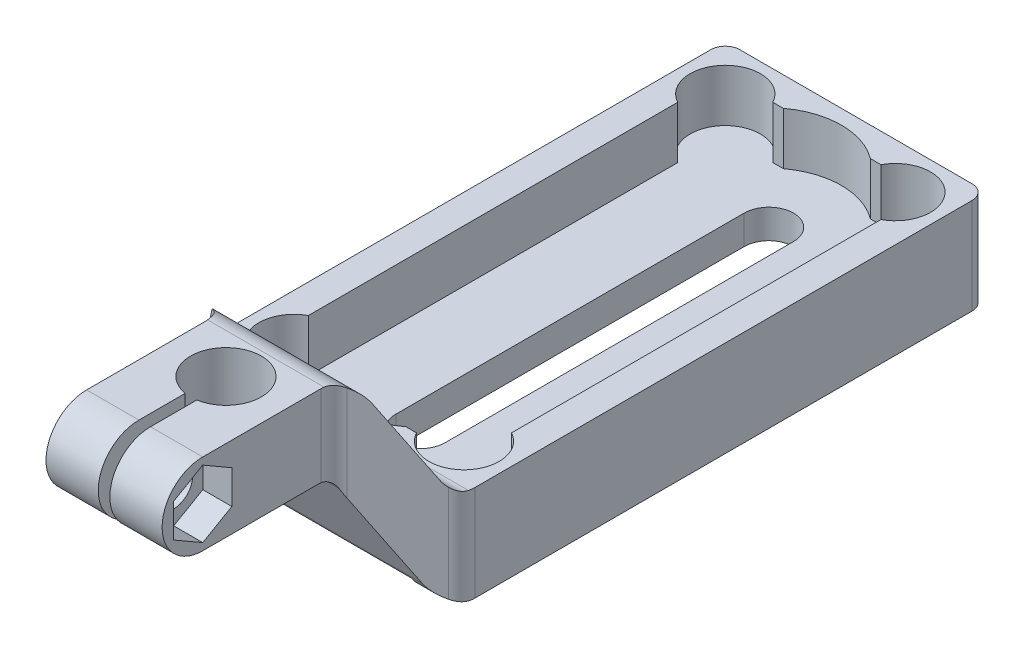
ISO-10303-21;
HEADER;
FILE_DESCRIPTION(('STEP AP214'),'2;1');
FILE_NAME('part.step','',(''),(''),'','','');
FILE_SCHEMA(('AUTOMOTIVE_DESIGN { 1 0 10303 214 1 1 1 1 }'));
ENDSEC;
DATA;
#1=APPLICATION_CONTEXT('core data for automotive mechanical design processes');
#2=APPLICATION_PROTOCOL_DEFINITION('international standard','automotive_design',2000,#1);
#3=PRODUCT_CONTEXT('',#1,'mechanical');
#4=PRODUCT('Part','Part','',(#3));
#5=PRODUCT_RELATED_PRODUCT_CATEGORY('part','',(#4));
#6=PRODUCT_DEFINITION_FORMATION('','',#4);
#7=PRODUCT_DEFINITION_CONTEXT('part definition',#1,'design');
#8=PRODUCT_DEFINITION('design','',#6,#7);
#9=PRODUCT_DEFINITION_SHAPE('','',#8);
#10=(LENGTH_UNIT() NAMED_UNIT(*) SI_UNIT(.MILLI.,.METRE.));
#11=(NAMED_UNIT(*) PLANE_ANGLE_UNIT() SI_UNIT($,.RADIAN.));
#12=(NAMED_UNIT(*) SI_UNIT($,.STERADIAN.) SOLID_ANGLE_UNIT());
#13=UNCERTAINTY_MEASURE_WITH_UNIT(LENGTH_MEASURE(1.E-05),#10,'distance_accuracy_value','');
#14=(GEOMETRIC_REPRESENTATION_CONTEXT(3) GLOBAL_UNCERTAINTY_ASSIGNED_CONTEXT((#13)) GLOBAL_UNIT_ASSIGNED_CONTEXT((#10,
#11,#12)) REPRESENTATION_CONTEXT('',''));
#15=CARTESIAN_POINT('',(0.,0.,0.));
#16=DIRECTION('',(0.,0.,1.));
#17=DIRECTION('',(1.,0.,0.));
#18=AXIS2_PLACEMENT_3D('',#15,#16,#17);
#19=CARTESIAN_POINT('',(5.,25.,78.1175836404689));
#20=DIRECTION('',(1.,0.,0.));
#21=DIRECTION('',(0.,0.,-1.));
#22=AXIS2_PLACEMENT_3D('',#19,#20,#21);
#23=PLANE('',#22);
#24=CARTESIAN_POINT('',(5.,25.,78.1175836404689));
#25=DIRECTION('',(-1.,0.,0.));
#26=DIRECTION('',(0.,-1.,0.));
#27=AXIS2_PLACEMENT_3D('',#24,#25,#26);
#28=CIRCLE('',#27,3.25);
#29=CARTESIAN_POINT('',(5.,21.75,78.1175836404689));
#30=VERTEX_POINT('',#29);
#31=EDGE_CURVE('E18',#30,#30,#28,.T.);
#32=ORIENTED_EDGE('',*,*,#31,.T.);
#33=EDGE_LOOP('',(#32));
#34=FACE_BOUND('',#33,.T.);
#35=DIRECTION('',(0.,0.5,-0.866025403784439));
#36=VECTOR('',#35,1.);
#37=CARTESIAN_POINT('',(5.,19.2207238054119,78.1175836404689));
#38=LINE('',#37,#36);
#39=CARTESIAN_POINT('',(5.,19.2207238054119,78.1175836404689));
#40=VERTEX_POINT('',#39);
#41=CARTESIAN_POINT('',(5.,22.1103619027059,73.1125836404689));
#42=VERTEX_POINT('',#41);
#43=EDGE_CURVE('E409',#40,#42,#38,.T.);
#44=ORIENTED_EDGE('',*,*,#43,.T.);
#45=DIRECTION('',(0.,1.,0.));
#46=VECTOR('',#45,1.);
#47=CARTESIAN_POINT('',(5.,25.,73.1125836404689));
#48=LINE('',#47,#46);
#49=CARTESIAN_POINT('',(5.,27.8896380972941,73.1125836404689));
#50=VERTEX_POINT('',#49);
#51=EDGE_CURVE('E403',#42,#50,#48,.T.);
#52=ORIENTED_EDGE('',*,*,#51,.T.);
#53=DIRECTION('',(0.,0.5,0.866025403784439));
#54=VECTOR('',#53,1.);
#55=CARTESIAN_POINT('',(5.,27.8896380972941,73.1125836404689));
#56=LINE('',#55,#54);
#57=CARTESIAN_POINT('',(5.,30.7792761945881,78.1175836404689));
#58=VERTEX_POINT('',#57);
#59=EDGE_CURVE('E393',#50,#58,#56,.T.);
#60=ORIENTED_EDGE('',*,*,#59,.T.);
#61=DIRECTION('',(0.,-0.5,0.866025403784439));
#62=VECTOR('',#61,1.);
#63=CARTESIAN_POINT('',(5.,30.7792761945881,78.1175836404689));
#64=LINE('',#63,#62);
#65=CARTESIAN_POINT('',(5.,27.8896380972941,83.1225836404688));
#66=VERTEX_POINT('',#65);
#67=EDGE_CURVE('E427',#58,#66,#64,.T.);
#68=ORIENTED_EDGE('',*,*,#67,.T.);
#69=DIRECTION('',(0.,1.,0.));
#70=VECTOR('',#69,1.);
#71=CARTESIAN_POINT('',(5.,27.8896380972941,83.1225836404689));
#72=LINE('',#71,#70);
#73=CARTESIAN_POINT('',(5.,22.1103619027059,83.1225836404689));
#74=VERTEX_POINT('',#73);
#75=EDGE_CURVE('E421',#66,#74,#72,.F.);
#76=ORIENTED_EDGE('',*,*,#75,.T.);
#77=DIRECTION('',(0.,-0.5,-0.866025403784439));
#78=VECTOR('',#77,1.);
#79=CARTESIAN_POINT('',(5.,22.1103619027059,83.1225836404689));
#80=LINE('',#79,#78);
#81=EDGE_CURVE('E415',#74,#40,#80,.T.);
#82=ORIENTED_EDGE('',*,*,#81,.T.);
#83=EDGE_LOOP('',(#44,#52,#60,#68,#76,#82));
#84=FACE_BOUND('',#83,.T.);
#85=ADVANCED_FACE('F15',(#34,#84),#23,.T.);
#86=CARTESIAN_POINT('',(0.,25.,78.1175836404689));
#87=DIRECTION('',(-1.,0.,0.));
#88=DIRECTION('',(0.,-1.,0.));
#89=AXIS2_PLACEMENT_3D('',#86,#87,#88);
#90=CYLINDRICAL_SURFACE('',#89,3.25);
#91=CARTESIAN_POINT('',(1.00000000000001,25.,78.1175836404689));
#92=DIRECTION('',(-1.,0.,0.));
#93=DIRECTION('',(0.,-1.,0.));
#94=AXIS2_PLACEMENT_3D('',#91,#92,#93);
#95=CIRCLE('',#94,3.25);
#96=CARTESIAN_POINT('',(1.00000000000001,21.75,78.1175836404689));
#97=VERTEX_POINT('',#96);
#98=EDGE_CURVE('E322',#97,#97,#95,.T.);
#99=ORIENTED_EDGE('',*,*,#98,.T.);
#100=EDGE_LOOP('',(#99));
#101=FACE_BOUND('',#100,.T.);
#102=ORIENTED_EDGE('',*,*,#31,.F.);
#103=EDGE_LOOP('',(#102));
#104=FACE_BOUND('',#103,.T.);
#105=ADVANCED_FACE('F725',(#101,#104),#90,.F.);
#106=CARTESIAN_POINT('',(10.,30.7792761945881,78.1175836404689));
#107=DIRECTION('',(0.,0.866025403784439,0.5));
#108=DIRECTION('',(0.,-0.5,0.866025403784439));
#109=AXIS2_PLACEMENT_3D('',#106,#107,#108);
#110=PLANE('',#109);
#111=DIRECTION('',(1.,0.,0.));
#112=VECTOR('',#111,1.);
#113=CARTESIAN_POINT('',(10.,30.7792761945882,78.1175836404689));
#114=LINE('',#113,#112);
#115=CARTESIAN_POINT('',(10.,30.7792761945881,78.1175836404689));
#116=VERTEX_POINT('',#115);
#117=EDGE_CURVE('E400',#58,#116,#114,.T.);
#118=ORIENTED_EDGE('',*,*,#117,.T.);
#119=DIRECTION('',(0.,-0.499999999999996,0.866025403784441));
#120=VECTOR('',#119,1.);
#121=CARTESIAN_POINT('',(10.,30.7792761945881,78.1175836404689));
#122=LINE('',#121,#120);
#123=CARTESIAN_POINT('',(10.,27.8896380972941,83.1225836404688));
#124=VERTEX_POINT('',#123);
#125=EDGE_CURVE('E379',#116,#124,#122,.T.);
#126=ORIENTED_EDGE('',*,*,#125,.T.);
#127=DIRECTION('',(1.,0.,0.));
#128=VECTOR('',#127,1.);
#129=CARTESIAN_POINT('',(10.,27.8896380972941,83.1225836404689));
#130=LINE('',#129,#128);
#131=EDGE_CURVE('E424',#124,#66,#130,.F.);
#132=ORIENTED_EDGE('',*,*,#131,.T.);
#133=ORIENTED_EDGE('',*,*,#67,.F.);
#134=EDGE_LOOP('',(#118,#126,#132,#133));
#135=FACE_BOUND('',#134,.T.);
#136=ADVANCED_FACE('F1171',(#135),#110,.F.);
#137=CARTESIAN_POINT('',(10.,27.8896380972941,83.1225836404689));
#138=DIRECTION('',(0.,0.,1.));
#139=DIRECTION('',(1.,0.,0.));
#140=AXIS2_PLACEMENT_3D('',#137,#138,#139);
#141=PLANE('',#140);
#142=ORIENTED_EDGE('',*,*,#131,.F.);
#143=DIRECTION('',(0.,1.,0.));
#144=VECTOR('',#143,1.);
#145=CARTESIAN_POINT('',(10.,37.,83.1225836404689));
#146=LINE('',#145,#144);
#147=CARTESIAN_POINT('',(10.,22.1103619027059,83.1225836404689));
#148=VERTEX_POINT('',#147);
#149=EDGE_CURVE('E376',#124,#148,#146,.F.);
#150=ORIENTED_EDGE('',*,*,#149,.T.);
#151=DIRECTION('',(1.,0.,0.));
#152=VECTOR('',#151,1.);
#153=CARTESIAN_POINT('',(10.,22.1103619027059,83.1225836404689));
#154=LINE('',#153,#152);
#155=EDGE_CURVE('E418',#148,#74,#154,.F.);
#156=ORIENTED_EDGE('',*,*,#155,.T.);
#157=ORIENTED_EDGE('',*,*,#75,.F.);
#158=EDGE_LOOP('',(#142,#150,#156,#157));
#159=FACE_BOUND('',#158,.T.);
#160=ADVANCED_FACE('F1163',(#159),#141,.F.);
#161=CARTESIAN_POINT('',(10.,22.1103619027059,83.1225836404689));
#162=DIRECTION('',(0.,-0.866025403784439,0.5));
#163=DIRECTION('',(0.,-0.5,-0.866025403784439));
#164=AXIS2_PLACEMENT_3D('',#161,#162,#163);
#165=PLANE('',#164);
#166=ORIENTED_EDGE('',*,*,#155,.F.);
#167=DIRECTION('',(0.,-0.499999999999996,-0.866025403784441));
#168=VECTOR('',#167,1.);
#169=CARTESIAN_POINT('',(10.,22.1103619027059,83.1225836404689));
#170=LINE('',#169,#168);
#171=CARTESIAN_POINT('',(10.,19.2207238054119,78.1175836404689));
#172=VERTEX_POINT('',#171);
#173=EDGE_CURVE('E373',#148,#172,#170,.T.);
#174=ORIENTED_EDGE('',*,*,#173,.T.);
#175=DIRECTION('',(1.,0.,0.));
#176=VECTOR('',#175,1.);
#177=CARTESIAN_POINT('',(10.,19.2207238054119,78.1175836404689));
#178=LINE('',#177,#176);
#179=EDGE_CURVE('E412',#172,#40,#178,.F.);
#180=ORIENTED_EDGE('',*,*,#179,.T.);
#181=ORIENTED_EDGE('',*,*,#81,.F.);
#182=EDGE_LOOP('',(#166,#174,#180,#181));
#183=FACE_BOUND('',#182,.T.);
#184=ADVANCED_FACE('F1155',(#183),#165,.F.);
#185=CARTESIAN_POINT('',(10.,19.2207238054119,78.1175836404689));
#186=DIRECTION('',(0.,-0.866025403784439,-0.5));
#187=DIRECTION('',(0.,0.5,-0.866025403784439));
#188=AXIS2_PLACEMENT_3D('',#185,#186,#187);
#189=PLANE('',#188);
#190=ORIENTED_EDGE('',*,*,#179,.F.);
#191=DIRECTION('',(0.,0.499999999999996,-0.866025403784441));
#192=VECTOR('',#191,1.);
#193=CARTESIAN_POINT('',(10.,19.2207238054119,78.1175836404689));
#194=LINE('',#193,#192);
#195=CARTESIAN_POINT('',(10.,22.1103619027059,73.1125836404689));
#196=VERTEX_POINT('',#195);
#197=EDGE_CURVE('E370',#172,#196,#194,.T.);
#198=ORIENTED_EDGE('',*,*,#197,.T.);
#199=DIRECTION('',(-1.,0.,0.));
#200=VECTOR('',#199,1.);
#201=CARTESIAN_POINT('',(10.,22.1103619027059,73.1125836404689));
#202=LINE('',#201,#200);
#203=EDGE_CURVE('E406',#196,#42,#202,.T.);
#204=ORIENTED_EDGE('',*,*,#203,.T.);
#205=ORIENTED_EDGE('',*,*,#43,.F.);
#206=EDGE_LOOP('',(#190,#198,#204,#205));
#207=FACE_BOUND('',#206,.T.);
#208=ADVANCED_FACE('F1147',(#207),#189,.F.);
#209=CARTESIAN_POINT('',(10.,25.,73.1125836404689));
#210=DIRECTION('',(0.,0.,-1.));
#211=DIRECTION('',(-1.,0.,0.));
#212=AXIS2_PLACEMENT_3D('',#209,#210,#211);
#213=PLANE('',#212);
#214=ORIENTED_EDGE('',*,*,#203,.F.);
#215=DIRECTION('',(0.,1.,0.));
#216=VECTOR('',#215,1.);
#217=CARTESIAN_POINT('',(10.,37.,73.1125836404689));
#218=LINE('',#217,#216);
#219=CARTESIAN_POINT('',(10.,27.8896380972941,73.1125836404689));
#220=VERTEX_POINT('',#219);
#221=EDGE_CURVE('E367',#196,#220,#218,.T.);
#222=ORIENTED_EDGE('',*,*,#221,.T.);
#223=DIRECTION('',(1.,0.,0.));
#224=VECTOR('',#223,1.);
#225=CARTESIAN_POINT('',(10.,27.8896380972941,73.1125836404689));
#226=LINE('',#225,#224);
#227=EDGE_CURVE('E397',#220,#50,#226,.F.);
#228=ORIENTED_EDGE('',*,*,#227,.T.);
#229=ORIENTED_EDGE('',*,*,#51,.F.);
#230=EDGE_LOOP('',(#214,#222,#228,#229));
#231=FACE_BOUND('',#230,.T.);
#232=ADVANCED_FACE('F1139',(#231),#213,.F.);
#233=CARTESIAN_POINT('',(10.,27.8896380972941,73.1125836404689));
#234=DIRECTION('',(0.,0.866025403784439,-0.5));
#235=DIRECTION('',(0.,0.5,0.866025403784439));
#236=AXIS2_PLACEMENT_3D('',#233,#234,#235);
#237=PLANE('',#236);
#238=ORIENTED_EDGE('',*,*,#227,.F.);
#239=DIRECTION('',(0.,0.499999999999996,0.866025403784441));
#240=VECTOR('',#239,1.);
#241=CARTESIAN_POINT('',(10.,27.8896380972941,73.1125836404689));
#242=LINE('',#241,#240);
#243=EDGE_CURVE('E364',#220,#116,#242,.T.);
#244=ORIENTED_EDGE('',*,*,#243,.T.);
#245=ORIENTED_EDGE('',*,*,#117,.F.);
#246=ORIENTED_EDGE('',*,*,#59,.F.);
#247=EDGE_LOOP('',(#238,#244,#245,#246));
#248=FACE_BOUND('',#247,.T.);
#249=ADVANCED_FACE('F736',(#248),#237,.F.);
#250=CARTESIAN_POINT('',(0.,25.,64.1175836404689));
#251=DIRECTION('',(0.,1.,0.));
#252=DIRECTION('',(-1.,0.,0.));
#253=AXIS2_PLACEMENT_3D('',#250,#251,#252);
#254=CYLINDRICAL_SURFACE('',#253,6.1);
#255=CARTESIAN_POINT('',(0.,18.,64.1175836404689));
#256=DIRECTION('',(0.,1.,0.));
#257=DIRECTION('',(-1.,0.,0.));
#258=AXIS2_PLACEMENT_3D('',#255,#256,#257);
#259=CIRCLE('',#258,6.1);
#260=CARTESIAN_POINT('',(-1.05029768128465,18.,58.1086840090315));
#261=VERTEX_POINT('',#260);
#262=CARTESIAN_POINT('',(-0.999999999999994,18.,70.135058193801));
#263=VERTEX_POINT('',#262);
#264=EDGE_CURVE('E363',#261,#263,#259,.T.);
#265=ORIENTED_EDGE('',*,*,#264,.F.);
#266=CARTESIAN_POINT('',(0.,18.,64.1175836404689));
#267=DIRECTION('',(0.,1.,0.));
#268=DIRECTION('',(-1.,0.,0.));
#269=AXIS2_PLACEMENT_3D('',#266,#267,#268);
#270=CIRCLE('',#269,6.1);
#271=CARTESIAN_POINT('',(1.05029768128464,18.,58.1086840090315));
#272=VERTEX_POINT('',#271);
#273=EDGE_CURVE('E384',#261,#272,#270,.F.);
#274=ORIENTED_EDGE('',*,*,#273,.T.);
#275=CARTESIAN_POINT('',(0.,18.,64.1175836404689));
#276=DIRECTION('',(0.,1.,0.));
#277=DIRECTION('',(-1.,0.,0.));
#278=AXIS2_PLACEMENT_3D('',#275,#276,#277);
#279=CIRCLE('',#278,6.1);
#280=CARTESIAN_POINT('',(1.00000000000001,18.,70.135058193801));
#281=VERTEX_POINT('',#280);
#282=EDGE_CURVE('E355',#281,#272,#279,.T.);
#283=ORIENTED_EDGE('',*,*,#282,.F.);
#284=DIRECTION('',(0.,1.,0.));
#285=VECTOR('',#284,1.);
#286=CARTESIAN_POINT('',(1.00000000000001,37.,70.135058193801));
#287=LINE('',#286,#285);
#288=CARTESIAN_POINT('',(1.00000000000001,32.,70.135058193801));
#289=VERTEX_POINT('',#288);
#290=EDGE_CURVE('E391',#281,#289,#287,.T.);
#291=ORIENTED_EDGE('',*,*,#290,.T.);
#292=CARTESIAN_POINT('',(0.,32.,64.1175836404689));
#293=DIRECTION('',(0.,1.,0.));
#294=DIRECTION('',(-1.,0.,0.));
#295=AXIS2_PLACEMENT_3D('',#292,#293,#294);
#296=CIRCLE('',#295,6.1);
#297=CARTESIAN_POINT('',(-0.999999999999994,32.,70.135058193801));
#298=VERTEX_POINT('',#297);
#299=EDGE_CURVE('E336',#298,#289,#296,.F.);
#300=ORIENTED_EDGE('',*,*,#299,.F.);
#301=DIRECTION('',(0.,1.,0.));
#302=VECTOR('',#301,1.);
#303=CARTESIAN_POINT('',(-0.999999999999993,37.,70.135058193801));
#304=LINE('',#303,#302);
#305=EDGE_CURVE('E321',#298,#263,#304,.F.);
#306=ORIENTED_EDGE('',*,*,#305,.T.);
#307=EDGE_LOOP('',(#265,#274,#283,#291,#300,#306));
#308=FACE_BOUND('',#307,.T.);
#309=ADVANCED_FACE('F704',(#308),#254,.F.);
#310=CARTESIAN_POINT('',(1.00000000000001,37.,85.1175836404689));
#311=DIRECTION('',(1.,0.,0.));
#312=DIRECTION('',(0.,0.,-1.));
#313=AXIS2_PLACEMENT_3D('',#310,#311,#312);
#314=PLANE('',#313);
#315=ORIENTED_EDGE('',*,*,#98,.F.);
#316=EDGE_LOOP('',(#315));
#317=FACE_BOUND('',#316,.T.);
#318=DIRECTION('',(0.,0.,-1.));
#319=VECTOR('',#318,1.);
#320=CARTESIAN_POINT('',(1.,18.,78.1175836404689));
#321=LINE('',#320,#319);
#322=CARTESIAN_POINT('',(1.,18.,78.1175836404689));
#323=VERTEX_POINT('',#322);
#324=EDGE_CURVE('E317',#323,#281,#321,.T.);
#325=ORIENTED_EDGE('',*,*,#324,.F.);
#326=CARTESIAN_POINT('',(1.,25.,78.1175836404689));
#327=DIRECTION('',(-1.,0.,0.));
#328=DIRECTION('',(0.,-1.,0.));
#329=AXIS2_PLACEMENT_3D('',#326,#327,#328);
#330=CIRCLE('',#329,7.);
#331=CARTESIAN_POINT('',(1.,32.,78.1175836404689));
#332=VERTEX_POINT('',#331);
#333=EDGE_CURVE('E309',#332,#323,#330,.F.);
#334=ORIENTED_EDGE('',*,*,#333,.F.);
#335=DIRECTION('',(0.,0.,1.));
#336=VECTOR('',#335,1.);
#337=CARTESIAN_POINT('',(1.,32.,57.2528014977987));
#338=LINE('',#337,#336);
#339=EDGE_CURVE('E314',#289,#332,#338,.T.);
#340=ORIENTED_EDGE('',*,*,#339,.F.);
#341=ORIENTED_EDGE('',*,*,#290,.F.);
#342=EDGE_LOOP('',(#325,#334,#340,#341));
#343=FACE_BOUND('',#342,.T.);
#344=ADVANCED_FACE('F311',(#317,#343),#314,.F.);
#345=CARTESIAN_POINT('',(22.5,25.,78.1175836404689));
#346=DIRECTION('',(-1.,0.,0.));
#347=DIRECTION('',(0.,-1.,0.));
#348=AXIS2_PLACEMENT_3D('',#345,#346,#347);
#349=CYLINDRICAL_SURFACE('',#348,7.);
#350=CARTESIAN_POINT('',(10.,25.,78.1175836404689));
#351=DIRECTION('',(-1.,0.,0.));
#352=DIRECTION('',(0.,-1.,0.));
#353=AXIS2_PLACEMENT_3D('',#350,#351,#352);
#354=CIRCLE('',#353,7.);
#355=CARTESIAN_POINT('',(10.,18.,78.1175836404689));
#356=VERTEX_POINT('',#355);
#357=CARTESIAN_POINT('',(10.,32.,78.1175836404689));
#358=VERTEX_POINT('',#357);
#359=EDGE_CURVE('E327',#356,#358,#354,.T.);
#360=ORIENTED_EDGE('',*,*,#359,.T.);
#361=DIRECTION('',(1.,0.,0.));
#362=VECTOR('',#361,1.);
#363=CARTESIAN_POINT('',(22.5,32.,78.1175836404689));
#364=LINE('',#363,#362);
#365=EDGE_CURVE('E325',#332,#358,#364,.T.);
#366=ORIENTED_EDGE('',*,*,#365,.F.);
#367=ORIENTED_EDGE('',*,*,#333,.T.);
#368=DIRECTION('',(1.,0.,0.));
#369=VECTOR('',#368,1.);
#370=CARTESIAN_POINT('',(22.5,18.,78.1175836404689));
#371=LINE('',#370,#369);
#372=EDGE_CURVE('E343',#356,#323,#371,.F.);
#373=ORIENTED_EDGE('',*,*,#372,.F.);
#374=EDGE_LOOP('',(#360,#366,#367,#373));
#375=FACE_BOUND('',#374,.T.);
#376=ADVANCED_FACE('F326',(#375),#349,.T.);
#377=CARTESIAN_POINT('',(-0.999999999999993,37.,64.1175836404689));
#378=DIRECTION('',(-1.,0.,0.));
#379=DIRECTION('',(0.,0.,1.));
#380=AXIS2_PLACEMENT_3D('',#377,#378,#379);
#381=PLANE('',#380);
#382=CARTESIAN_POINT('',(-0.999999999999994,25.,78.1175836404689));
#383=DIRECTION('',(-1.,0.,0.));
#384=DIRECTION('',(0.,-1.,0.));
#385=AXIS2_PLACEMENT_3D('',#382,#383,#384);
#386=CIRCLE('',#385,3.25);
#387=CARTESIAN_POINT('',(-0.999999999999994,21.75,78.1175836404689));
#388=VERTEX_POINT('',#387);
#389=EDGE_CURVE('E715',#388,#388,#386,.T.);
#390=ORIENTED_EDGE('',*,*,#389,.T.);
#391=EDGE_LOOP('',(#390));
#392=FACE_BOUND('',#391,.T.);
#393=DIRECTION('',(0.,0.,1.));
#394=VECTOR('',#393,1.);
#395=CARTESIAN_POINT('',(-0.999999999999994,32.,57.2528014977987));
#396=LINE('',#395,#394);
#397=CARTESIAN_POINT('',(-0.999999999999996,32.,78.1175836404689));
#398=VERTEX_POINT('',#397);
#399=EDGE_CURVE('E387',#398,#298,#396,.F.);
#400=ORIENTED_EDGE('',*,*,#399,.F.);
#401=CARTESIAN_POINT('',(-0.999999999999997,25.,78.1175836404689));
#402=DIRECTION('',(-1.,0.,0.));
#403=DIRECTION('',(0.,-1.,0.));
#404=AXIS2_PLACEMENT_3D('',#401,#402,#403);
#405=CIRCLE('',#404,7.);
#406=CARTESIAN_POINT('',(-0.999999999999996,18.,78.1175836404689));
#407=VERTEX_POINT('',#406);
#408=EDGE_CURVE('E389',#407,#398,#405,.T.);
#409=ORIENTED_EDGE('',*,*,#408,.F.);
#410=DIRECTION('',(0.,0.,-1.));
#411=VECTOR('',#410,1.);
#412=CARTESIAN_POINT('',(-0.999999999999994,18.,78.1175836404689));
#413=LINE('',#412,#411);
#414=EDGE_CURVE('E359',#263,#407,#413,.F.);
#415=ORIENTED_EDGE('',*,*,#414,.F.);
#416=ORIENTED_EDGE('',*,*,#305,.F.);
#417=EDGE_LOOP('',(#400,#409,#415,#416));
#418=FACE_BOUND('',#417,.T.);
#419=ADVANCED_FACE('F699',(#392,#418),#381,.F.);
#420=CARTESIAN_POINT('',(22.5,25.,78.1175836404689));
#421=DIRECTION('',(-1.,0.,0.));
#422=DIRECTION('',(0.,-1.,0.));
#423=AXIS2_PLACEMENT_3D('',#420,#421,#422);
#424=CYLINDRICAL_SURFACE('',#423,7.);
#425=ORIENTED_EDGE('',*,*,#408,.T.);
#426=DIRECTION('',(1.,0.,0.));
#427=VECTOR('',#426,1.);
#428=CARTESIAN_POINT('',(22.5,32.,78.1175836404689));
#429=LINE('',#428,#427);
#430=CARTESIAN_POINT('',(-9.99999999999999,32.,78.1175836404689));
#431=VERTEX_POINT('',#430);
#432=EDGE_CURVE('E385',#431,#398,#429,.T.);
#433=ORIENTED_EDGE('',*,*,#432,.F.);
#434=CARTESIAN_POINT('',(-9.99999999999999,25.,78.1175836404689));
#435=DIRECTION('',(-1.,0.,0.));
#436=DIRECTION('',(0.,-1.,0.));
#437=AXIS2_PLACEMENT_3D('',#434,#435,#436);
#438=CIRCLE('',#437,7.);
#439=CARTESIAN_POINT('',(-9.99999999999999,18.,78.1175836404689));
#440=VERTEX_POINT('',#439);
#441=EDGE_CURVE('E693',#431,#440,#438,.F.);
#442=ORIENTED_EDGE('',*,*,#441,.T.);
#443=DIRECTION('',(1.,0.,0.));
#444=VECTOR('',#443,1.);
#445=CARTESIAN_POINT('',(22.5,18.,78.1175836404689));
#446=LINE('',#445,#444);
#447=EDGE_CURVE('E362',#407,#440,#446,.F.);
#448=ORIENTED_EDGE('',*,*,#447,.F.);
#449=EDGE_LOOP('',(#425,#433,#442,#448));
#450=FACE_BOUND('',#449,.T.);
#451=ADVANCED_FACE('F1104',(#450),#424,.T.);
#452=CARTESIAN_POINT('',(0.,25.,78.1175836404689));
#453=DIRECTION('',(-1.,0.,0.));
#454=DIRECTION('',(0.,-1.,0.));
#455=AXIS2_PLACEMENT_3D('',#452,#453,#454);
#456=CYLINDRICAL_SURFACE('',#455,3.25);
#457=CARTESIAN_POINT('',(-10.,25.,78.1175836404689));
#458=DIRECTION('',(-1.,0.,0.));
#459=DIRECTION('',(0.,-1.,0.));
#460=AXIS2_PLACEMENT_3D('',#457,#458,#459);
#461=CIRCLE('',#460,3.25);
#462=CARTESIAN_POINT('',(-10.,21.75,78.1175836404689));
#463=VERTEX_POINT('',#462);
#464=EDGE_CURVE('E686',#463,#463,#461,.T.);
#465=ORIENTED_EDGE('',*,*,#464,.T.);
#466=EDGE_LOOP('',(#465));
#467=FACE_BOUND('',#466,.T.);
#468=ORIENTED_EDGE('',*,*,#389,.F.);
#469=EDGE_LOOP('',(#468));
#470=FACE_BOUND('',#469,.T.);
#471=ADVANCED_FACE('F1096',(#467,#470),#456,.F.);
#472=CARTESIAN_POINT('',(10.,37.,57.7910425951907));
#473=DIRECTION('',(-1.,0.,0.));
#474=DIRECTION('',(0.,0.,1.));
#475=AXIS2_PLACEMENT_3D('',#472,#473,#474);
#476=PLANE('',#475);
#477=ORIENTED_EDGE('',*,*,#221,.F.);
#478=ORIENTED_EDGE('',*,*,#197,.F.);
#479=ORIENTED_EDGE('',*,*,#173,.F.);
#480=ORIENTED_EDGE('',*,*,#149,.F.);
#481=ORIENTED_EDGE('',*,*,#125,.F.);
#482=ORIENTED_EDGE('',*,*,#243,.F.);
#483=EDGE_LOOP('',(#477,#478,#479,#480,#481,#482));
#484=FACE_BOUND('',#483,.T.);
#485=ORIENTED_EDGE('',*,*,#359,.F.);
#486=DIRECTION('',(0.,0.,-1.));
#487=VECTOR('',#486,1.);
#488=CARTESIAN_POINT('',(10.,18.,78.1175836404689));
#489=LINE('',#488,#487);
#490=CARTESIAN_POINT('',(10.,18.,58.1086840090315));
#491=VERTEX_POINT('',#490);
#492=EDGE_CURVE('E352',#491,#356,#489,.F.);
#493=ORIENTED_EDGE('',*,*,#492,.F.);
#494=CARTESIAN_POINT('',(10.,15.,58.1086840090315));
#495=DIRECTION('',(-1.,0.,0.));
#496=DIRECTION('',(0.,-1.,0.));
#497=AXIS2_PLACEMENT_3D('',#494,#495,#496);
#498=CIRCLE('',#497,3.);
#499=CARTESIAN_POINT('',(10.,17.9831365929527,57.7910425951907));
#500=VERTEX_POINT('',#499);
#501=EDGE_CURVE('E712',#500,#491,#498,.F.);
#502=ORIENTED_EDGE('',*,*,#501,.F.);
#503=DIRECTION('',(0.,-1.,0.));
#504=VECTOR('',#503,1.);
#505=CARTESIAN_POINT('',(10.,37.,57.7910425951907));
#506=LINE('',#505,#504);
#507=CARTESIAN_POINT('',(10.,32.,57.7910425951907));
#508=VERTEX_POINT('',#507);
#509=EDGE_CURVE('E683',#500,#508,#506,.F.);
#510=ORIENTED_EDGE('',*,*,#509,.T.);
#511=DIRECTION('',(0.,0.,1.));
#512=VECTOR('',#511,1.);
#513=CARTESIAN_POINT('',(10.,32.,57.2528014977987));
#514=LINE('',#513,#512);
#515=EDGE_CURVE('E331',#358,#508,#514,.F.);
#516=ORIENTED_EDGE('',*,*,#515,.F.);
#517=EDGE_LOOP('',(#485,#493,#502,#510,#516));
#518=FACE_BOUND('',#517,.T.);
#519=ADVANCED_FACE('F711',(#484,#518),#476,.F.);
#520=CARTESIAN_POINT('',(22.5,18.,78.1175836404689));
#521=DIRECTION('',(0.,-1.,0.));
#522=DIRECTION('',(0.,0.,-1.));
#523=AXIS2_PLACEMENT_3D('',#520,#521,#522);
#524=PLANE('',#523);
#525=DIRECTION('',(0.,0.,-1.));
#526=VECTOR('',#525,1.);
#527=CARTESIAN_POINT('',(-9.99999999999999,18.,85.1175836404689));
#528=LINE('',#527,#526);
#529=CARTESIAN_POINT('',(-9.99999999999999,18.,58.1086840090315));
#530=VERTEX_POINT('',#529);
#531=EDGE_CURVE('E691',#440,#530,#528,.T.);
#532=ORIENTED_EDGE('',*,*,#531,.T.);
#533=DIRECTION('',(-1.,0.,0.));
#534=VECTOR('',#533,1.);
#535=CARTESIAN_POINT('',(22.5,18.,58.1086840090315));
#536=LINE('',#535,#534);
#537=EDGE_CURVE('E348',#530,#261,#536,.F.);
#538=ORIENTED_EDGE('',*,*,#537,.T.);
#539=ORIENTED_EDGE('',*,*,#264,.T.);
#540=ORIENTED_EDGE('',*,*,#414,.T.);
#541=ORIENTED_EDGE('',*,*,#447,.T.);
#542=EDGE_LOOP('',(#532,#538,#539,#540,#541));
#543=FACE_BOUND('',#542,.T.);
#544=ADVANCED_FACE('F1082',(#543),#524,.T.);
#545=CARTESIAN_POINT('',(3.05,18.,64.1175836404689));
#546=DIRECTION('',(0.,-1.,0.));
#547=DIRECTION('',(0.,0.,-1.));
#548=AXIS2_PLACEMENT_3D('',#545,#546,#547);
#549=PLANE('',#548);
#550=ORIENTED_EDGE('',*,*,#273,.F.);
#551=DIRECTION('',(-1.,0.,0.));
#552=VECTOR('',#551,1.);
#553=CARTESIAN_POINT('',(22.5,18.,58.1086840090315));
#554=LINE('',#553,#552);
#555=EDGE_CURVE('E344',#261,#272,#554,.F.);
#556=ORIENTED_EDGE('',*,*,#555,.T.);
#557=EDGE_LOOP('',(#550,#556));
#558=FACE_BOUND('',#557,.T.);
#559=ADVANCED_FACE('F892',(#558),#549,.F.);
#560=CARTESIAN_POINT('',(22.5,18.,78.1175836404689));
#561=DIRECTION('',(0.,-1.,0.));
#562=DIRECTION('',(0.,0.,-1.));
#563=AXIS2_PLACEMENT_3D('',#560,#561,#562);
#564=PLANE('',#563);
#565=ORIENTED_EDGE('',*,*,#372,.T.);
#566=ORIENTED_EDGE('',*,*,#324,.T.);
#567=ORIENTED_EDGE('',*,*,#282,.T.);
#568=DIRECTION('',(-1.,0.,0.));
#569=VECTOR('',#568,1.);
#570=CARTESIAN_POINT('',(22.5,18.,58.1086840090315));
#571=LINE('',#570,#569);
#572=EDGE_CURVE('E347',#272,#491,#571,.F.);
#573=ORIENTED_EDGE('',*,*,#572,.T.);
#574=ORIENTED_EDGE('',*,*,#492,.T.);
#575=EDGE_LOOP('',(#565,#566,#567,#573,#574));
#576=FACE_BOUND('',#575,.T.);
#577=ADVANCED_FACE('F707',(#576),#564,.T.);
#578=CARTESIAN_POINT('',(22.5,32.,57.2528014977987));
#579=DIRECTION('',(0.,1.,0.));
#580=DIRECTION('',(0.,0.,1.));
#581=AXIS2_PLACEMENT_3D('',#578,#579,#580);
#582=PLANE('',#581);
#583=ORIENTED_EDGE('',*,*,#432,.T.);
#584=ORIENTED_EDGE('',*,*,#399,.T.);
#585=ORIENTED_EDGE('',*,*,#299,.T.);
#586=ORIENTED_EDGE('',*,*,#339,.T.);
#587=ORIENTED_EDGE('',*,*,#365,.T.);
#588=ORIENTED_EDGE('',*,*,#515,.T.);
#589=CARTESIAN_POINT('',(14.,32.,57.7910425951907));
#590=DIRECTION('',(0.,-1.,0.));
#591=DIRECTION('',(1.,0.,0.));
#592=AXIS2_PLACEMENT_3D('',#589,#590,#591);
#593=CIRCLE('',#592,4.00000000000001);
#594=CARTESIAN_POINT('',(10.0363783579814,32.,57.2528014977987));
#595=VERTEX_POINT('',#594);
#596=EDGE_CURVE('E685',#508,#595,#593,.T.);
#597=ORIENTED_EDGE('',*,*,#596,.T.);
#598=DIRECTION('',(-1.,0.,0.));
#599=VECTOR('',#598,1.);
#600=CARTESIAN_POINT('',(22.5,32.,57.2528014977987));
#601=LINE('',#600,#599);
#602=CARTESIAN_POINT('',(-10.0363783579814,32.,57.2528014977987));
#603=VERTEX_POINT('',#602);
#604=EDGE_CURVE('E680',#603,#595,#601,.F.);
#605=ORIENTED_EDGE('',*,*,#604,.F.);
#606=CARTESIAN_POINT('',(-14.,32.,57.7910425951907));
#607=DIRECTION('',(0.,-1.,0.));
#608=DIRECTION('',(1.,0.,0.));
#609=AXIS2_PLACEMENT_3D('',#606,#607,#608);
#610=CIRCLE('',#609,4.00000000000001);
#611=CARTESIAN_POINT('',(-9.99999999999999,32.,57.7910425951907));
#612=VERTEX_POINT('',#611);
#613=EDGE_CURVE('E388',#603,#612,#610,.T.);
#614=ORIENTED_EDGE('',*,*,#613,.T.);
#615=DIRECTION('',(0.,0.,-1.));
#616=VECTOR('',#615,1.);
#617=CARTESIAN_POINT('',(-9.99999999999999,32.,85.1175836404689));
#618=LINE('',#617,#616);
#619=EDGE_CURVE('E694',#612,#431,#618,.F.);
#620=ORIENTED_EDGE('',*,*,#619,.T.);
#621=EDGE_LOOP('',(#583,#584,#585,#586,#587,#588,#597,#605,#614,#620));
#622=FACE_BOUND('',#621,.T.);
#623=ADVANCED_FACE('F334',(#622),#582,.T.);
#624=CARTESIAN_POINT('',(-9.99999999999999,37.,85.1175836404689));
#625=DIRECTION('',(1.,0.,0.));
#626=DIRECTION('',(0.,0.,-1.));
#627=AXIS2_PLACEMENT_3D('',#624,#625,#626);
#628=PLANE('',#627);
#629=ORIENTED_EDGE('',*,*,#464,.F.);
#630=EDGE_LOOP('',(#629));
#631=FACE_BOUND('',#630,.T.);
#632=ORIENTED_EDGE('',*,*,#531,.F.);
#633=ORIENTED_EDGE('',*,*,#441,.F.);
#634=ORIENTED_EDGE('',*,*,#619,.F.);
#635=DIRECTION('',(0.,-1.,0.));
#636=VECTOR('',#635,1.);
#637=CARTESIAN_POINT('',(-9.99999999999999,37.,57.7910425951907));
#638=LINE('',#637,#636);
#639=CARTESIAN_POINT('',(-10.,17.9831365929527,57.7910425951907));
#640=VERTEX_POINT('',#639);
#641=EDGE_CURVE('E673',#612,#640,#638,.T.);
#642=ORIENTED_EDGE('',*,*,#641,.T.);
#643=CARTESIAN_POINT('',(-10.,15.,58.1086840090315));
#644=DIRECTION('',(-1.,0.,0.));
#645=DIRECTION('',(0.,-1.,0.));
#646=AXIS2_PLACEMENT_3D('',#643,#644,#645);
#647=CIRCLE('',#646,3.);
#648=EDGE_CURVE('E358',#640,#530,#647,.F.);
#649=ORIENTED_EDGE('',*,*,#648,.T.);
#650=EDGE_LOOP('',(#632,#633,#634,#642,#649));
#651=FACE_BOUND('',#650,.T.);
#652=ADVANCED_FACE('F1057',(#631,#651),#628,.F.);
#653=CARTESIAN_POINT('',(22.5,12.9373695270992,20.4384675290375));
#654=DIRECTION('',(1.,0.,0.));
#655=DIRECTION('',(0.,0.,-1.));
#656=AXIS2_PLACEMENT_3D('',#653,#654,#655);
#657=PLANE('',#656);
#658=DIRECTION('',(0.,-1.,0.));
#659=VECTOR('',#658,1.);
#660=CARTESIAN_POINT('',(22.5,37.,43.7340565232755));
#661=LINE('',#660,#659);
#662=CARTESIAN_POINT('',(22.5,0.,43.7340565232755));
#663=VERTEX_POINT('',#662);
#664=CARTESIAN_POINT('',(22.5,16.5,43.7340565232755));
#665=VERTEX_POINT('',#664);
#666=EDGE_CURVE('E595',#663,#665,#661,.F.);
#667=ORIENTED_EDGE('',*,*,#666,.F.);
#668=DIRECTION('',(0.,0.,-1.));
#669=VECTOR('',#668,1.);
#670=CARTESIAN_POINT('',(22.5,0.,44.3824163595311));
#671=LINE('',#670,#669);
#672=CARTESIAN_POINT('',(22.5,0.,-41.8824163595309));
#673=VERTEX_POINT('',#672);
#674=EDGE_CURVE('E596',#673,#663,#671,.F.);
#675=ORIENTED_EDGE('',*,*,#674,.F.);
#676=DIRECTION('',(0.,-1.,0.));
#677=VECTOR('',#676,1.);
#678=CARTESIAN_POINT('',(22.5,37.,-41.8824163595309));
#679=LINE('',#678,#677);
#680=CARTESIAN_POINT('',(22.5,16.5,-41.8824163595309));
#681=VERTEX_POINT('',#680);
#682=EDGE_CURVE('E689',#681,#673,#679,.T.);
#683=ORIENTED_EDGE('',*,*,#682,.F.);
#684=DIRECTION('',(0.,0.,1.));
#685=VECTOR('',#684,1.);
#686=CARTESIAN_POINT('',(22.5,16.5,-44.3824163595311));
#687=LINE('',#686,#685);
#688=EDGE_CURVE('E634',#665,#681,#687,.F.);
#689=ORIENTED_EDGE('',*,*,#688,.F.);
#690=EDGE_LOOP('',(#667,#675,#683,#689));
#691=FACE_BOUND('',#690,.T.);
#692=ADVANCED_FACE('F956',(#691),#657,.T.);
#693=CARTESIAN_POINT('',(14.,37.,57.7910425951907));
#694=DIRECTION('',(0.,-1.,0.));
#695=DIRECTION('',(1.,0.,0.));
#696=AXIS2_PLACEMENT_3D('',#693,#694,#695);
#697=CYLINDRICAL_SURFACE('',#696,4.00000000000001);
#698=ORIENTED_EDGE('',*,*,#596,.F.);
#699=ORIENTED_EDGE('',*,*,#509,.F.);
#700=CARTESIAN_POINT('',(10.,17.9831365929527,57.7910425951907));
#701=CARTESIAN_POINT('',(9.99998327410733,17.975170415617,57.716078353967));
#702=CARTESIAN_POINT('',(10.0021067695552,17.9643496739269,57.6414364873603));
#703=CARTESIAN_POINT('',(10.0104022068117,17.9371952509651,57.4934494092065));
#704=CARTESIAN_POINT('',(10.0165709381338,17.9208659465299,57.4201032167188));
#705=CARTESIAN_POINT('',(10.0326639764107,17.8830221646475,57.2757908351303));
#706=CARTESIAN_POINT('',(10.0425592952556,17.86154816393,57.2048107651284));
#707=CARTESIAN_POINT('',(10.0657803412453,17.8136228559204,57.0651400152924));
#708=CARTESIAN_POINT('',(10.0791066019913,17.7871707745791,56.9964496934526));
#709=CARTESIAN_POINT('',(10.123600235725,17.7009542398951,56.7948648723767));
#710=CARTESIAN_POINT('',(10.1593498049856,17.6341795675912,56.6658947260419));
#711=CARTESIAN_POINT('',(10.2398243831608,17.4842470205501,56.4207050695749));
#712=CARTESIAN_POINT('',(10.2845713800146,17.4010490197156,56.3045178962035));
#713=CARTESIAN_POINT('',(10.3844664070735,17.2109222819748,56.0748893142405));
#714=CARTESIAN_POINT('',(10.4402132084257,17.1024190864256,55.9630171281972));
#715=CARTESIAN_POINT('',(10.5533163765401,16.8701181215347,55.7578024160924));
#716=CARTESIAN_POINT('',(10.6106702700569,16.7463429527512,55.6644330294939));
#717=CARTESIAN_POINT('',(10.687040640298,16.5660830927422,55.5492236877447));
#718=CARTESIAN_POINT('',(10.707744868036,16.5155484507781,55.5189734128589));
#719=CARTESIAN_POINT('',(10.7482313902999,16.4125712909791,55.4613997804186));
#720=CARTESIAN_POINT('',(10.7680147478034,16.3601311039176,55.4340729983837));
#721=CARTESIAN_POINT('',(10.7871848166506,16.306721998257,55.4082252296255));
#722=B_SPLINE_CURVE_WITH_KNOTS('',3,(#700,#701,#702,#703,#704,#705,#706,#707,#708,#709,#710,
#711,#712,#713,#714,#715,#716,#717,#718,#719,#720,#721),.UNSPECIFIED.,.F.,.F.,(4,2,2,2,2,2,2,2,
2,2,4),(0.,0.226046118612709,0.451913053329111,0.676058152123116,0.900238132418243,
1.34686442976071,1.79459575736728,2.28933811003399,2.783356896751,2.97056340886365,
3.1575481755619),.UNSPECIFIED.);
#723=CARTESIAN_POINT('',(10.7871848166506,16.306721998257,55.4082252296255));
#724=VERTEX_POINT('',#723);
#725=EDGE_CURVE('E351',#500,#724,#722,.T.);
#726=ORIENTED_EDGE('',*,*,#725,.T.);
#727=CARTESIAN_POINT('',(14.,21.2310288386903,57.7910425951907));
#728=DIRECTION('',(0.,-0.435573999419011,0.900152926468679));
#729=DIRECTION('',(0.,-0.900152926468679,-0.435573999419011));
#730=AXIS2_PLACEMENT_3D('',#727,#728,#729);
#731=ELLIPSE('',#730,9.18328459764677,4.00000000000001);
#732=CARTESIAN_POINT('',(11.4595784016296,14.8458813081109,54.701340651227));
#733=VERTEX_POINT('',#732);
#734=EDGE_CURVE('E583',#733,#724,#731,.F.);
#735=ORIENTED_EDGE('',*,*,#734,.F.);
#736=DIRECTION('',(0.,1.,0.));
#737=VECTOR('',#736,1.);
#738=CARTESIAN_POINT('',(11.4595784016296,37.,54.701340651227));
#739=LINE('',#738,#737);
#740=CARTESIAN_POINT('',(11.4595784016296,31.3000055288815,54.701340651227));
#741=VERTEX_POINT('',#740);
#742=EDGE_CURVE('E591',#733,#741,#739,.T.);
#743=ORIENTED_EDGE('',*,*,#742,.T.);
#744=CARTESIAN_POINT('',(10.0363783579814,32.,57.2528014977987));
#745=CARTESIAN_POINT('',(10.049782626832,32.0000225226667,57.1539294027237));
#746=CARTESIAN_POINT('',(10.0669249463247,31.9970681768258,57.0555932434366));
#747=CARTESIAN_POINT('',(10.1083904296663,31.985562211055,56.8608657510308));
#748=CARTESIAN_POINT('',(10.1327073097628,31.9770154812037,56.7644727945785));
#749=CARTESIAN_POINT('',(10.1880316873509,31.9547682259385,56.5750801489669));
#750=CARTESIAN_POINT('',(10.2189848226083,31.9411089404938,56.4820596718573));
#751=CARTESIAN_POINT('',(10.2873076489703,31.9091098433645,56.2992492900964));
#752=CARTESIAN_POINT('',(10.3246783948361,31.8907692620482,56.2094599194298));
#753=CARTESIAN_POINT('',(10.4455341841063,31.8296444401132,55.9463542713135));
#754=CARTESIAN_POINT('',(10.5379998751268,31.7806559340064,55.7785024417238));
#755=CARTESIAN_POINT('',(10.7437814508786,31.6706369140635,55.4601349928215));
#756=CARTESIAN_POINT('',(10.857144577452,31.609579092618,55.3096599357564));
#757=CARTESIAN_POINT('',(11.0533810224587,31.5059308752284,55.0836160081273));
#758=CARTESIAN_POINT('',(11.1305698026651,31.465592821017,55.0019672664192));
#759=CARTESIAN_POINT('',(11.2907597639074,31.3835759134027,54.8461457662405));
#760=CARTESIAN_POINT('',(11.3737339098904,31.3419037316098,54.7719417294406));
#761=CARTESIAN_POINT('',(11.4595784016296,31.3000055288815,54.701340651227));
#762=B_SPLINE_CURVE_WITH_KNOTS('',3,(#744,#745,#746,#747,#748,#749,#750,#751,#752,#753,#754,
#755,#756,#757,#758,#759,#760,#761),.UNSPECIFIED.,.F.,.F.,(4,2,2,2,2,2,2,2,4),(0.,
0.299171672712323,0.598082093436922,0.89463159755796,1.1912298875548,1.7819428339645,
2.37400792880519,2.73180158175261,3.08802281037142),.UNSPECIFIED.);
#763=EDGE_CURVE('E679',#595,#741,#762,.T.);
#764=ORIENTED_EDGE('',*,*,#763,.F.);
#765=EDGE_LOOP('',(#698,#699,#726,#735,#743,#764));
#766=FACE_BOUND('',#765,.T.);
#767=ADVANCED_FACE('F869',(#766),#697,.F.);
#768=CARTESIAN_POINT('',(22.5,15.,58.1086840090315));
#769=DIRECTION('',(-1.,0.,0.));
#770=DIRECTION('',(0.,-1.,0.));
#771=AXIS2_PLACEMENT_3D('',#768,#769,#770);
#772=CYLINDRICAL_SURFACE('',#771,3.);
#773=DIRECTION('',(1.,0.,0.));
#774=VECTOR('',#773,1.);
#775=CARTESIAN_POINT('',(22.5,16.306721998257,55.4082252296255));
#776=LINE('',#775,#774);
#777=CARTESIAN_POINT('',(-10.7871848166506,16.306721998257,55.4082252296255));
#778=VERTEX_POINT('',#777);
#779=EDGE_CURVE('E580',#724,#778,#776,.F.);
#780=ORIENTED_EDGE('',*,*,#779,.F.);
#781=ORIENTED_EDGE('',*,*,#725,.F.);
#782=ORIENTED_EDGE('',*,*,#501,.T.);
#783=ORIENTED_EDGE('',*,*,#572,.F.);
#784=ORIENTED_EDGE('',*,*,#555,.F.);
#785=ORIENTED_EDGE('',*,*,#537,.F.);
#786=ORIENTED_EDGE('',*,*,#648,.F.);
#787=CARTESIAN_POINT('',(-10.,17.9831365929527,57.7910425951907));
#788=CARTESIAN_POINT('',(-9.99998327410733,17.975170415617,57.716078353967));
#789=CARTESIAN_POINT('',(-10.0021067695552,17.9643496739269,57.6414364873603));
#790=CARTESIAN_POINT('',(-10.0104022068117,17.9371952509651,57.4934494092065));
#791=CARTESIAN_POINT('',(-10.0165709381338,17.9208659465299,57.4201032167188));
#792=CARTESIAN_POINT('',(-10.0326639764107,17.8830221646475,57.2757908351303));
#793=CARTESIAN_POINT('',(-10.0425592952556,17.86154816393,57.2048107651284));
#794=CARTESIAN_POINT('',(-10.0657803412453,17.8136228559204,57.0651400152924));
#795=CARTESIAN_POINT('',(-10.0791066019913,17.7871707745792,56.9964496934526));
#796=CARTESIAN_POINT('',(-10.123600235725,17.7009542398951,56.7948648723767));
#797=CARTESIAN_POINT('',(-10.1593498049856,17.6341795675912,56.6658947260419));
#798=CARTESIAN_POINT('',(-10.2398243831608,17.4842470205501,56.4207050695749));
#799=CARTESIAN_POINT('',(-10.2845713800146,17.4010490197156,56.3045178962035));
#800=CARTESIAN_POINT('',(-10.3844664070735,17.2109222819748,56.0748893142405));
#801=CARTESIAN_POINT('',(-10.4402132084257,17.1024190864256,55.9630171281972));
#802=CARTESIAN_POINT('',(-10.5533163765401,16.8701181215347,55.7578024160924));
#803=CARTESIAN_POINT('',(-10.6106702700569,16.7463429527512,55.6644330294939));
#804=CARTESIAN_POINT('',(-10.687040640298,16.5660830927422,55.5492236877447));
#805=CARTESIAN_POINT('',(-10.707744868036,16.5155484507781,55.5189734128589));
#806=CARTESIAN_POINT('',(-10.7482313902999,16.4125712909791,55.4613997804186));
#807=CARTESIAN_POINT('',(-10.7680147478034,16.3601311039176,55.4340729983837));
#808=CARTESIAN_POINT('',(-10.7871848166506,16.306721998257,55.4082252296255));
#809=B_SPLINE_CURVE_WITH_KNOTS('',3,(#787,#788,#789,#790,#791,#792,#793,#794,#795,#796,#797,
#798,#799,#800,#801,#802,#803,#804,#805,#806,#807,#808),.UNSPECIFIED.,.F.,.F.,(4,2,2,2,2,2,2,2,
2,2,4),(0.,0.226046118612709,0.451913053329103,0.676058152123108,0.900238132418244,
1.3468644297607,1.79459575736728,2.28933811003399,2.783356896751,2.97056340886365,
3.1575481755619),.UNSPECIFIED.);
#810=EDGE_CURVE('E672',#640,#778,#809,.T.);
#811=ORIENTED_EDGE('',*,*,#810,.T.);
#812=EDGE_LOOP('',(#780,#781,#782,#783,#784,#785,#786,#811));
#813=FACE_BOUND('',#812,.T.);
#814=ADVANCED_FACE('F863',(#813),#772,.F.);
#815=CARTESIAN_POINT('',(22.5,18.1933172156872,47.4369306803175));
#816=DIRECTION('',(0.,0.435560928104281,-0.900159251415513));
#817=DIRECTION('',(0.,0.900159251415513,0.435560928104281));
#818=AXIS2_PLACEMENT_3D('',#815,#816,#817);
#819=PLANE('',#818);
#820=DIRECTION('',(0.468111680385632,-0.795443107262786,-0.384891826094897));
#821=VECTOR('',#820,1.);
#822=CARTESIAN_POINT('',(13.830391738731,29.1778046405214,52.7520052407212));
#823=LINE('',#822,#821);
#824=CARTESIAN_POINT('',(13.830391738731,29.1778046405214,52.7520052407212));
#825=VERTEX_POINT('',#824);
#826=CARTESIAN_POINT('',(20.2946716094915,18.1933172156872,47.4369306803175));
#827=VERTEX_POINT('',#826);
#828=EDGE_CURVE('E588',#825,#827,#823,.T.);
#829=ORIENTED_EDGE('',*,*,#828,.T.);
#830=DIRECTION('',(-1.,0.,0.));
#831=VECTOR('',#830,1.);
#832=CARTESIAN_POINT('',(22.5,18.1933172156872,47.4369306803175));
#833=LINE('',#832,#831);
#834=CARTESIAN_POINT('',(-20.2946716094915,18.1933172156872,47.4369306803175));
#835=VERTEX_POINT('',#834);
#836=EDGE_CURVE('E668',#827,#835,#833,.T.);
#837=ORIENTED_EDGE('',*,*,#836,.T.);
#838=DIRECTION('',(0.468111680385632,0.795443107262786,0.384891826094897));
#839=VECTOR('',#838,1.);
#840=CARTESIAN_POINT('',(-20.2946716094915,18.1933172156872,47.4369306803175));
#841=LINE('',#840,#839);
#842=CARTESIAN_POINT('',(-13.830391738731,29.1778046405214,52.7520052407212));
#843=VERTEX_POINT('',#842);
#844=EDGE_CURVE('E577',#835,#843,#841,.T.);
#845=ORIENTED_EDGE('',*,*,#844,.T.);
#846=DIRECTION('',(-1.,0.,0.));
#847=VECTOR('',#846,1.);
#848=CARTESIAN_POINT('',(22.5,29.1778046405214,52.7520052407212));
#849=LINE('',#848,#847);
#850=EDGE_CURVE('E676',#825,#843,#849,.T.);
#851=ORIENTED_EDGE('',*,*,#850,.F.);
#852=EDGE_LOOP('',(#829,#837,#845,#851));
#853=FACE_BOUND('',#852,.T.);
#854=ADVANCED_FACE('F868',(#853),#819,.T.);
#855=CARTESIAN_POINT('',(22.5,27.,57.2528014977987));
#856=DIRECTION('',(-1.,0.,0.));
#857=DIRECTION('',(0.,-1.,0.));
#858=AXIS2_PLACEMENT_3D('',#855,#856,#857);
#859=CYLINDRICAL_SURFACE('',#858,5.);
#860=CARTESIAN_POINT('',(8.35645034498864,27.,57.2528014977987));
#861=DIRECTION('',(-0.635105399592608,0.,-0.772425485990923));
#862=DIRECTION('',(-0.772425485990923,0.,0.635105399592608));
#863=AXIS2_PLACEMENT_3D('',#860,#861,#862);
#864=ELLIPSE('',#863,7.87270900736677,5.);
#865=EDGE_CURVE('E590',#741,#825,#864,.T.);
#866=ORIENTED_EDGE('',*,*,#865,.T.);
#867=ORIENTED_EDGE('',*,*,#850,.T.);
#868=CARTESIAN_POINT('',(-8.35645034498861,27.,57.2528014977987));
#869=DIRECTION('',(0.635105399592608,0.,-0.772425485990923));
#870=DIRECTION('',(-0.772425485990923,0.,-0.635105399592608));
#871=AXIS2_PLACEMENT_3D('',#868,#869,#870);
#872=ELLIPSE('',#871,7.87270900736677,5.);
#873=CARTESIAN_POINT('',(-11.4595784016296,31.3000055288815,54.701340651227));
#874=VERTEX_POINT('',#873);
#875=EDGE_CURVE('E576',#843,#874,#872,.T.);
#876=ORIENTED_EDGE('',*,*,#875,.T.);
#877=CARTESIAN_POINT('',(-11.4595784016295,31.3000055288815,54.701340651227));
#878=CARTESIAN_POINT('',(-11.3773893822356,31.34011820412,54.7689293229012));
#879=CARTESIAN_POINT('',(-11.297813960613,31.3800342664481,54.8398451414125));
#880=CARTESIAN_POINT('',(-11.1441878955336,31.4585579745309,54.9882278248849));
#881=CARTESIAN_POINT('',(-11.070141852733,31.4971645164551,55.0657000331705));
#882=CARTESIAN_POINT('',(-10.9272034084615,31.5725092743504,55.2278941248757));
#883=CARTESIAN_POINT('',(-10.8583789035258,31.6092213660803,55.3126882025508));
#884=CARTESIAN_POINT('',(-10.7273383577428,31.6793366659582,55.4884999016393));
#885=CARTESIAN_POINT('',(-10.6651206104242,31.712740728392,55.5795159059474));
#886=CARTESIAN_POINT('',(-10.5474725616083,31.7755064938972,55.7680552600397));
#887=CARTESIAN_POINT('',(-10.4920883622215,31.8048408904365,55.8656166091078));
#888=CARTESIAN_POINT('',(-10.3892400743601,31.8582634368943,56.0661925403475));
#889=CARTESIAN_POINT('',(-10.3417742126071,31.8823527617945,56.1692058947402));
#890=CARTESIAN_POINT('',(-10.2556933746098,31.924268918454,56.3793146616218));
#891=CARTESIAN_POINT('',(-10.2170242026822,31.9421344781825,56.4863800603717));
#892=CARTESIAN_POINT('',(-10.1487947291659,31.9710246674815,56.7042036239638));
#893=CARTESIAN_POINT('',(-10.1192259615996,31.9820556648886,56.8149582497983));
#894=CARTESIAN_POINT('',(-10.0825405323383,31.9928857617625,56.9807630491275));
#895=CARTESIAN_POINT('',(-10.0717422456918,31.9955427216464,57.0348452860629));
#896=CARTESIAN_POINT('',(-10.0523765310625,31.9991008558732,57.1434967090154));
#897=CARTESIAN_POINT('',(-10.0438103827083,32.0000010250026,57.198066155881));
#898=CARTESIAN_POINT('',(-10.0363783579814,32.,57.2528014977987));
#899=B_SPLINE_CURVE_WITH_KNOTS('',3,(#877,#878,#879,#880,#881,#882,#883,#884,#885,#886,#887,
#888,#889,#890,#891,#892,#893,#894,#895,#896,#897,#898),.UNSPECIFIED.,.F.,.F.,(4,2,2,2,2,2,2,2,
2,2,4),(0.,0.341111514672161,0.68250375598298,1.02776399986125,1.37293484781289,
1.72031997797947,2.06762720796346,2.41273297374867,2.75751671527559,2.92309293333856,
3.08876386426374),.UNSPECIFIED.);
#900=EDGE_CURVE('E675',#874,#603,#899,.T.);
#901=ORIENTED_EDGE('',*,*,#900,.T.);
#902=ORIENTED_EDGE('',*,*,#604,.T.);
#903=ORIENTED_EDGE('',*,*,#763,.T.);
#904=EDGE_LOOP('',(#866,#867,#876,#901,#902,#903));
#905=FACE_BOUND('',#904,.T.);
#906=ADVANCED_FACE('F908',(#905),#859,.T.);
#907=CARTESIAN_POINT('',(-14.,37.,57.7910425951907));
#908=DIRECTION('',(0.,-1.,0.));
#909=DIRECTION('',(1.,0.,0.));
#910=AXIS2_PLACEMENT_3D('',#907,#908,#909);
#911=CYLINDRICAL_SURFACE('',#910,4.00000000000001);
#912=ORIENTED_EDGE('',*,*,#810,.F.);
#913=ORIENTED_EDGE('',*,*,#641,.F.);
#914=ORIENTED_EDGE('',*,*,#613,.F.);
#915=ORIENTED_EDGE('',*,*,#900,.F.);
#916=DIRECTION('',(0.,1.,0.));
#917=VECTOR('',#916,1.);
#918=CARTESIAN_POINT('',(-11.4595784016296,37.,54.701340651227));
#919=LINE('',#918,#917);
#920=CARTESIAN_POINT('',(-11.4595784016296,14.8458813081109,54.701340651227));
#921=VERTEX_POINT('',#920);
#922=EDGE_CURVE('E574',#874,#921,#919,.F.);
#923=ORIENTED_EDGE('',*,*,#922,.T.);
#924=CARTESIAN_POINT('',(-14.,21.2310288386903,57.7910425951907));
#925=DIRECTION('',(0.,-0.435573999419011,0.900152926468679));
#926=DIRECTION('',(0.,-0.900152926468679,-0.435573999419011));
#927=AXIS2_PLACEMENT_3D('',#924,#925,#926);
#928=ELLIPSE('',#927,9.18328459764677,4.00000000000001);
#929=EDGE_CURVE('E579',#778,#921,#928,.F.);
#930=ORIENTED_EDGE('',*,*,#929,.F.);
#931=EDGE_LOOP('',(#912,#913,#914,#915,#923,#930));
#932=FACE_BOUND('',#931,.T.);
#933=ADVANCED_FACE('F492',(#932),#911,.F.);
#934=CARTESIAN_POINT('',(22.5,19.5,44.736452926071));
#935=DIRECTION('',(-1.,0.,0.));
#936=DIRECTION('',(0.,-1.,0.));
#937=AXIS2_PLACEMENT_3D('',#934,#935,#936);
#938=CYLINDRICAL_SURFACE('',#937,3.);
#939=CARTESIAN_POINT('',(-23.5790364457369,19.5,44.736452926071));
#940=DIRECTION('',(0.635105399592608,0.,-0.772425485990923));
#941=DIRECTION('',(-0.772425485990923,0.,-0.635105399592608));
#942=AXIS2_PLACEMENT_3D('',#939,#940,#941);
#943=ELLIPSE('',#942,4.72362540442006,3.);
#944=CARTESIAN_POINT('',(-21.0404215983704,17.3452017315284,46.8237584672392));
#945=VERTEX_POINT('',#944);
#946=EDGE_CURVE('E573',#945,#835,#943,.F.);
#947=ORIENTED_EDGE('',*,*,#946,.T.);
#948=ORIENTED_EDGE('',*,*,#836,.F.);
#949=CARTESIAN_POINT('',(23.5790364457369,19.5,44.736452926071));
#950=DIRECTION('',(-0.635105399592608,0.,-0.772425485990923));
#951=DIRECTION('',(-0.772425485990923,0.,0.635105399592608));
#952=AXIS2_PLACEMENT_3D('',#949,#950,#951);
#953=ELLIPSE('',#952,4.72362540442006,3.);
#954=CARTESIAN_POINT('',(21.0404215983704,17.3452017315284,46.8237584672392));
#955=VERTEX_POINT('',#954);
#956=EDGE_CURVE('E587',#827,#955,#953,.F.);
#957=ORIENTED_EDGE('',*,*,#956,.T.);
#958=CARTESIAN_POINT('',(22.3723638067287,16.5,44.736452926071));
#959=CARTESIAN_POINT('',(22.3517369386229,16.4999846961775,44.8162167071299));
#960=CARTESIAN_POINT('',(22.3286175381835,16.5031799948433,44.8952954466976));
#961=CARTESIAN_POINT('',(22.2777479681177,16.5155529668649,45.0513663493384));
#962=CARTESIAN_POINT('',(22.2500036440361,16.5247231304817,45.1283610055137));
#963=CARTESIAN_POINT('',(22.1904933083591,16.5484860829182,45.2789705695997));
#964=CARTESIAN_POINT('',(22.1587716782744,16.5630220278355,45.3526121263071));
#965=CARTESIAN_POINT('',(22.0914668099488,16.5970395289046,45.4969269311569));
#966=CARTESIAN_POINT('',(22.0558825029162,16.6165224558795,45.5675993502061));
#967=CARTESIAN_POINT('',(21.9443123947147,16.6814257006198,45.7739167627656));
#968=CARTESIAN_POINT('',(21.8631505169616,16.733451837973,45.9047552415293));
#969=CARTESIAN_POINT('',(21.6897129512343,16.8516357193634,46.152473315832));
#970=CARTESIAN_POINT('',(21.5973946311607,16.9178484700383,46.2692957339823));
#971=CARTESIAN_POINT('',(21.4281021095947,17.043510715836,46.4613898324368));
#972=CARTESIAN_POINT('',(21.3529249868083,17.1006299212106,46.5398212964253));
#973=CARTESIAN_POINT('',(21.199137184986,17.2195868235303,46.688031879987));
#974=CARTESIAN_POINT('',(21.1205521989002,17.2813911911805,46.757864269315));
#975=CARTESIAN_POINT('',(21.0404215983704,17.3452017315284,46.8237584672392));
#976=B_SPLINE_CURVE_WITH_KNOTS('',3,(#958,#959,#960,#961,#962,#963,#964,#965,#966,#967,#968,
#969,#970,#971,#972,#973,#974,#975),.UNSPECIFIED.,.F.,.F.,(4,2,2,2,2,2,2,2,4),(0.,
0.247002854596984,0.493695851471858,0.737847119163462,0.982066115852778,1.4676158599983,
1.95508347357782,2.32287759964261,2.68826451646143),.UNSPECIFIED.);
#977=CARTESIAN_POINT('',(22.3723638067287,16.5,44.736452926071));
#978=VERTEX_POINT('',#977);
#979=EDGE_CURVE('E499',#978,#955,#976,.T.);
#980=ORIENTED_EDGE('',*,*,#979,.F.);
#981=DIRECTION('',(1.,0.,0.));
#982=VECTOR('',#981,1.);
#983=CARTESIAN_POINT('',(22.5,16.5,44.736452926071));
#984=LINE('',#983,#982);
#985=CARTESIAN_POINT('',(-22.3723638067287,16.5,44.736452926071));
#986=VERTEX_POINT('',#985);
#987=EDGE_CURVE('E636',#986,#978,#984,.T.);
#988=ORIENTED_EDGE('',*,*,#987,.F.);
#989=CARTESIAN_POINT('',(-21.0404215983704,17.3452017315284,46.8237584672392));
#990=CARTESIAN_POINT('',(-21.1238567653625,17.2787620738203,46.7551462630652));
#991=CARTESIAN_POINT('',(-21.205633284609,17.2144807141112,46.682249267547));
#992=CARTESIAN_POINT('',(-21.3652263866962,17.0912074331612,46.5274247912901));
#993=CARTESIAN_POINT('',(-21.4430273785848,17.0322357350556,46.445465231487));
#994=CARTESIAN_POINT('',(-21.5943697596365,16.9203433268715,46.2714417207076));
#995=CARTESIAN_POINT('',(-21.6678434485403,16.8675102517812,46.1792613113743));
#996=CARTESIAN_POINT('',(-21.808046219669,16.7704544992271,45.9859628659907));
#997=CARTESIAN_POINT('',(-21.8747865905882,16.726217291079,45.8848603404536));
#998=CARTESIAN_POINT('',(-22.0137862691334,16.6396067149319,45.6512040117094));
#999=CARTESIAN_POINT('',(-22.0841539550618,16.5996727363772,45.5165580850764));
#1000=CARTESIAN_POINT('',(-22.1784839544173,16.5539184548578,45.3071439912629));
#1001=CARTESIAN_POINT('',(-22.2079869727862,16.5410420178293,45.2363163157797));
#1002=CARTESIAN_POINT('',(-22.2630685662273,16.5203129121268,45.092448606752));
#1003=CARTESIAN_POINT('',(-22.2886497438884,16.5124569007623,45.0194100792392));
#1004=CARTESIAN_POINT('',(-22.3230913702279,16.5048842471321,44.911038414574));
#1005=CARTESIAN_POINT('',(-22.3335969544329,16.5030611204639,44.8763565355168));
#1006=CARTESIAN_POINT('',(-22.3536829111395,16.5006183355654,44.8066443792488));
#1007=CARTESIAN_POINT('',(-22.3632622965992,16.4999999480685,44.7716137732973));
#1008=CARTESIAN_POINT('',(-22.3723638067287,16.5,44.736452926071));
#1009=B_SPLINE_CURVE_WITH_KNOTS('',3,(#989,#990,#991,#992,#993,#994,#995,#996,#997,#998,#999,
#1000,#1001,#1002,#1003,#1004,#1005,#1006,#1007,#1008),.UNSPECIFIED.,.F.,.F.,(4,2,2,2,2,2,2,2,2,
4),(0.,0.380500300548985,0.762393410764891,1.14920102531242,1.53534897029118,2.00440400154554,
2.2375716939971,2.47058397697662,2.57940774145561,2.68834622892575),.UNSPECIFIED.);
#1010=EDGE_CURVE('E473',#945,#986,#1009,.T.);
#1011=ORIENTED_EDGE('',*,*,#1010,.F.);
#1012=EDGE_LOOP('',(#947,#948,#957,#980,#988,#1011));
#1013=FACE_BOUND('',#1012,.T.);
#1014=ADVANCED_FACE('F486',(#1013),#938,.F.);
#1015=CARTESIAN_POINT('',(-22.5,12.9373695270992,20.4384675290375));
#1016=DIRECTION('',(1.,0.,0.));
#1017=DIRECTION('',(0.,0.,-1.));
#1018=AXIS2_PLACEMENT_3D('',#1015,#1016,#1017);
#1019=PLANE('',#1018);
#1020=DIRECTION('',(0.,0.,-1.));
#1021=VECTOR('',#1020,1.);
#1022=CARTESIAN_POINT('',(-22.5,0.,44.3824163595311));
#1023=LINE('',#1022,#1021);
#1024=CARTESIAN_POINT('',(-22.5,0.,43.7340565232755));
#1025=VERTEX_POINT('',#1024);
#1026=CARTESIAN_POINT('',(-22.5,0.,-41.8824163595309));
#1027=VERTEX_POINT('',#1026);
#1028=EDGE_CURVE('E553',#1025,#1027,#1023,.T.);
#1029=ORIENTED_EDGE('',*,*,#1028,.F.);
#1030=DIRECTION('',(0.,-1.,0.));
#1031=VECTOR('',#1030,1.);
#1032=CARTESIAN_POINT('',(-22.5,37.,43.7340565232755));
#1033=LINE('',#1032,#1031);
#1034=CARTESIAN_POINT('',(-22.5,16.5,43.7340565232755));
#1035=VERTEX_POINT('',#1034);
#1036=EDGE_CURVE('E570',#1035,#1025,#1033,.T.);
#1037=ORIENTED_EDGE('',*,*,#1036,.F.);
#1038=DIRECTION('',(0.,0.,1.));
#1039=VECTOR('',#1038,1.);
#1040=CARTESIAN_POINT('',(-22.5,16.5,-44.3824163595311));
#1041=LINE('',#1040,#1039);
#1042=CARTESIAN_POINT('',(-22.5,16.5,-41.8824163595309));
#1043=VERTEX_POINT('',#1042);
#1044=EDGE_CURVE('E638',#1043,#1035,#1041,.T.);
#1045=ORIENTED_EDGE('',*,*,#1044,.F.);
#1046=DIRECTION('',(0.,-1.,0.));
#1047=VECTOR('',#1046,1.);
#1048=CARTESIAN_POINT('',(-22.5,37.,-41.8824163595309));
#1049=LINE('',#1048,#1047);
#1050=EDGE_CURVE('E645',#1027,#1043,#1049,.F.);
#1051=ORIENTED_EDGE('',*,*,#1050,.F.);
#1052=EDGE_LOOP('',(#1029,#1037,#1045,#1051));
#1053=FACE_BOUND('',#1052,.T.);
#1054=ADVANCED_FACE('F491',(#1053),#1019,.F.);
#1055=CARTESIAN_POINT('',(7.49999999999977,16.5,40.6175836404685));
#1056=DIRECTION('',(0.,0.,1.));
#1057=DIRECTION('',(1.,0.,0.));
#1058=AXIS2_PLACEMENT_3D('',#1055,#1056,#1057);
#1059=PLANE('',#1058);
#1060=DIRECTION('',(0.,-1.,0.));
#1061=VECTOR('',#1060,1.);
#1062=CARTESIAN_POINT('',(7.49999999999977,16.5,40.6175836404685));
#1063=LINE('',#1062,#1061);
#1064=CARTESIAN_POINT('',(7.49999999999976,7.5,40.6175836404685));
#1065=VERTEX_POINT('',#1064);
#1066=CARTESIAN_POINT('',(7.49999999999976,16.5,40.6175836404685));
#1067=VERTEX_POINT('',#1066);
#1068=EDGE_CURVE('E666',#1065,#1067,#1063,.F.);
#1069=ORIENTED_EDGE('',*,*,#1068,.T.);
#1070=DIRECTION('',(1.,0.,0.));
#1071=VECTOR('',#1070,1.);
#1072=CARTESIAN_POINT('',(22.5,16.5,40.6175836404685));
#1073=LINE('',#1072,#1071);
#1074=CARTESIAN_POINT('',(9.31333437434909,16.5,40.6175836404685));
#1075=VERTEX_POINT('',#1074);
#1076=EDGE_CURVE('E630',#1075,#1067,#1073,.F.);
#1077=ORIENTED_EDGE('',*,*,#1076,.F.);
#1078=DIRECTION('',(0.,-1.,0.));
#1079=VECTOR('',#1078,1.);
#1080=CARTESIAN_POINT('',(9.31333437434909,16.5,40.6175836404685));
#1081=LINE('',#1080,#1079);
#1082=CARTESIAN_POINT('',(9.31333437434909,7.5,40.6175836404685));
#1083=VERTEX_POINT('',#1082);
#1084=EDGE_CURVE('E643',#1075,#1083,#1081,.T.);
#1085=ORIENTED_EDGE('',*,*,#1084,.T.);
#1086=DIRECTION('',(1.,0.,0.));
#1087=VECTOR('',#1086,1.);
#1088=CARTESIAN_POINT('',(-1.740251E-13,7.5,40.6175836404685));
#1089=LINE('',#1088,#1087);
#1090=EDGE_CURVE('E551',#1083,#1065,#1089,.F.);
#1091=ORIENTED_EDGE('',*,*,#1090,.T.);
#1092=EDGE_LOOP('',(#1069,#1077,#1085,#1091));
#1093=FACE_BOUND('',#1092,.T.);
#1094=ADVANCED_FACE('F990',(#1093),#1059,.F.);
#1095=CARTESIAN_POINT('',(-1.327329E-13,16.5,30.6175836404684));
#1096=DIRECTION('',(0.,-1.,0.));
#1097=DIRECTION('',(1.,0.,0.));
#1098=AXIS2_PLACEMENT_3D('',#1095,#1096,#1097);
#1099=CYLINDRICAL_SURFACE('',#1098,12.5);
#1100=DIRECTION('',(0.,1.,0.));
#1101=VECTOR('',#1100,1.);
#1102=CARTESIAN_POINT('',(-7.50000000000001,16.5,40.6175836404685));
#1103=LINE('',#1102,#1101);
#1104=CARTESIAN_POINT('',(-7.50000000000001,7.5,40.6175836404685));
#1105=VERTEX_POINT('',#1104);
#1106=CARTESIAN_POINT('',(-7.50000000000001,16.5,40.6175836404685));
#1107=VERTEX_POINT('',#1106);
#1108=EDGE_CURVE('E664',#1105,#1107,#1103,.T.);
#1109=ORIENTED_EDGE('',*,*,#1108,.T.);
#1110=CARTESIAN_POINT('',(-1.327329E-13,16.5,30.6175836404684));
#1111=DIRECTION('',(0.,-1.,0.));
#1112=DIRECTION('',(1.,0.,0.));
#1113=AXIS2_PLACEMENT_3D('',#1110,#1111,#1112);
#1114=CIRCLE('',#1113,12.5);
#1115=EDGE_CURVE('E629',#1067,#1107,#1114,.T.);
#1116=ORIENTED_EDGE('',*,*,#1115,.F.);
#1117=ORIENTED_EDGE('',*,*,#1068,.F.);
#1118=CARTESIAN_POINT('',(-1.338350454E-13,7.5,30.6175836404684));
#1119=DIRECTION('',(0.,-1.,0.));
#1120=DIRECTION('',(1.,0.,0.));
#1121=AXIS2_PLACEMENT_3D('',#1118,#1119,#1120);
#1122=CIRCLE('',#1121,12.5);
#1123=EDGE_CURVE('E550',#1065,#1105,#1122,.T.);
#1124=ORIENTED_EDGE('',*,*,#1123,.T.);
#1125=EDGE_LOOP('',(#1109,#1116,#1117,#1124));
#1126=FACE_BOUND('',#1125,.T.);
#1127=ADVANCED_FACE('F994',(#1126),#1099,.F.);
#1128=CARTESIAN_POINT('',(-9.31333437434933,16.5,40.6175836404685));
#1129=DIRECTION('',(0.,0.,1.));
#1130=DIRECTION('',(1.,0.,0.));
#1131=AXIS2_PLACEMENT_3D('',#1128,#1129,#1130);
#1132=PLANE('',#1131);
#1133=DIRECTION('',(0.,-1.,0.));
#1134=VECTOR('',#1133,1.);
#1135=CARTESIAN_POINT('',(-9.31333437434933,16.5,40.6175836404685));
#1136=LINE('',#1135,#1134);
#1137=CARTESIAN_POINT('',(-9.31333437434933,7.5,40.6175836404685));
#1138=VERTEX_POINT('',#1137);
#1139=CARTESIAN_POINT('',(-9.31333437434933,16.5,40.6175836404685));
#1140=VERTEX_POINT('',#1139);
#1141=EDGE_CURVE('E662',#1138,#1140,#1136,.F.);
#1142=ORIENTED_EDGE('',*,*,#1141,.T.);
#1143=DIRECTION('',(1.,0.,0.));
#1144=VECTOR('',#1143,1.);
#1145=CARTESIAN_POINT('',(22.5,16.5,40.6175836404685));
#1146=LINE('',#1145,#1144);
#1147=EDGE_CURVE('E626',#1107,#1140,#1146,.F.);
#1148=ORIENTED_EDGE('',*,*,#1147,.F.);
#1149=ORIENTED_EDGE('',*,*,#1108,.F.);
#1150=DIRECTION('',(1.,0.,0.));
#1151=VECTOR('',#1150,1.);
#1152=CARTESIAN_POINT('',(-1.740251E-13,7.5,40.6175836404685));
#1153=LINE('',#1152,#1151);
#1154=EDGE_CURVE('E549',#1105,#1138,#1153,.F.);
#1155=ORIENTED_EDGE('',*,*,#1154,.T.);
#1156=EDGE_LOOP('',(#1142,#1148,#1149,#1155));
#1157=FACE_BOUND('',#1156,.T.);
#1158=ADVANCED_FACE('F815',(#1157),#1132,.F.);
#1159=CARTESIAN_POINT('',(-14.6500000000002,16.5,37.767583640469));
#1160=DIRECTION('',(0.,-1.,0.));
#1161=DIRECTION('',(1.,0.,0.));
#1162=AXIS2_PLACEMENT_3D('',#1159,#1160,#1161);
#1163=CYLINDRICAL_SURFACE('',#1162,6.05000000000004);
#1164=DIRECTION('',(0.,1.,0.));
#1165=VECTOR('',#1164,1.);
#1166=CARTESIAN_POINT('',(-17.5000000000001,16.5,32.4309180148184));
#1167=LINE('',#1166,#1165);
#1168=CARTESIAN_POINT('',(-17.5000000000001,7.5,32.4309180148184));
#1169=VERTEX_POINT('',#1168);
#1170=CARTESIAN_POINT('',(-17.5000000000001,16.5,32.4309180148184));
#1171=VERTEX_POINT('',#1170);
#1172=EDGE_CURVE('E660',#1169,#1171,#1167,.T.);
#1173=ORIENTED_EDGE('',*,*,#1172,.T.);
#1174=CARTESIAN_POINT('',(-14.6500000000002,16.5,37.767583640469));
#1175=DIRECTION('',(0.,-1.,0.));
#1176=DIRECTION('',(1.,0.,0.));
#1177=AXIS2_PLACEMENT_3D('',#1174,#1175,#1176);
#1178=CIRCLE('',#1177,6.05000000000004);
#1179=EDGE_CURVE('E625',#1140,#1171,#1178,.T.);
#1180=ORIENTED_EDGE('',*,*,#1179,.F.);
#1181=ORIENTED_EDGE('',*,*,#1141,.F.);
#1182=CARTESIAN_POINT('',(-14.6500000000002,7.5,37.767583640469));
#1183=DIRECTION('',(0.,-1.,0.));
#1184=DIRECTION('',(1.,0.,0.));
#1185=AXIS2_PLACEMENT_3D('',#1182,#1183,#1184);
#1186=CIRCLE('',#1185,6.05000000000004);
#1187=EDGE_CURVE('E547',#1138,#1169,#1186,.T.);
#1188=ORIENTED_EDGE('',*,*,#1187,.T.);
#1189=EDGE_LOOP('',(#1173,#1180,#1181,#1188));
#1190=FACE_BOUND('',#1189,.T.);
#1191=ADVANCED_FACE('F822',(#1190),#1163,.F.);
#1192=CARTESIAN_POINT('',(-17.5000000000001,16.5,-31.1957507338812));
#1193=DIRECTION('',(-1.,0.,0.));
#1194=DIRECTION('',(0.,0.,1.));
#1195=AXIS2_PLACEMENT_3D('',#1192,#1193,#1194);
#1196=PLANE('',#1195);
#1197=DIRECTION('',(0.,-1.,0.));
#1198=VECTOR('',#1197,1.);
#1199=CARTESIAN_POINT('',(-17.5000000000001,16.5,-31.1957507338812));
#1200=LINE('',#1199,#1198);
#1201=CARTESIAN_POINT('',(-17.5000000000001,7.5,-31.1957507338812));
#1202=VERTEX_POINT('',#1201);
#1203=CARTESIAN_POINT('',(-17.5000000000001,16.5,-31.1957507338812));
#1204=VERTEX_POINT('',#1203);
#1205=EDGE_CURVE('E658',#1202,#1204,#1200,.F.);
#1206=ORIENTED_EDGE('',*,*,#1205,.T.);
#1207=DIRECTION('',(0.,0.,1.));
#1208=VECTOR('',#1207,1.);
#1209=CARTESIAN_POINT('',(-17.5000000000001,16.5,-44.3824163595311));
#1210=LINE('',#1209,#1208);
#1211=EDGE_CURVE('E622',#1171,#1204,#1210,.F.);
#1212=ORIENTED_EDGE('',*,*,#1211,.F.);
#1213=ORIENTED_EDGE('',*,*,#1172,.F.);
#1214=DIRECTION('',(0.,0.,-1.));
#1215=VECTOR('',#1214,1.);
#1216=CARTESIAN_POINT('',(-17.5000000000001,7.5,0.617583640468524));
#1217=LINE('',#1216,#1215);
#1218=EDGE_CURVE('E546',#1169,#1202,#1217,.T.);
#1219=ORIENTED_EDGE('',*,*,#1218,.T.);
#1220=EDGE_LOOP('',(#1206,#1212,#1213,#1219));
#1221=FACE_BOUND('',#1220,.T.);
#1222=ADVANCED_FACE('F832',(#1221),#1196,.F.);
#1223=CARTESIAN_POINT('',(-14.6500000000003,16.5,-36.5324163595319));
#1224=DIRECTION('',(0.,-1.,0.));
#1225=DIRECTION('',(1.,0.,0.));
#1226=AXIS2_PLACEMENT_3D('',#1223,#1224,#1225);
#1227=CYLINDRICAL_SURFACE('',#1226,6.05000000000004);
#1228=DIRECTION('',(0.,1.,0.));
#1229=VECTOR('',#1228,1.);
#1230=CARTESIAN_POINT('',(-9.31333437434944,16.5,-39.3824163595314));
#1231=LINE('',#1230,#1229);
#1232=CARTESIAN_POINT('',(-9.31333437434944,7.5,-39.3824163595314));
#1233=VERTEX_POINT('',#1232);
#1234=CARTESIAN_POINT('',(-9.31333437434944,16.5,-39.3824163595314));
#1235=VERTEX_POINT('',#1234);
#1236=EDGE_CURVE('E656',#1233,#1235,#1231,.T.);
#1237=ORIENTED_EDGE('',*,*,#1236,.T.);
#1238=CARTESIAN_POINT('',(-14.6500000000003,16.5,-36.5324163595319));
#1239=DIRECTION('',(0.,-1.,0.));
#1240=DIRECTION('',(1.,0.,0.));
#1241=AXIS2_PLACEMENT_3D('',#1238,#1239,#1240);
#1242=CIRCLE('',#1241,6.05000000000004);
#1243=EDGE_CURVE('E621',#1204,#1235,#1242,.T.);
#1244=ORIENTED_EDGE('',*,*,#1243,.F.);
#1245=ORIENTED_EDGE('',*,*,#1205,.F.);
#1246=CARTESIAN_POINT('',(-14.6500000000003,7.5,-36.5324163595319));
#1247=DIRECTION('',(0.,-1.,0.));
#1248=DIRECTION('',(1.,0.,0.));
#1249=AXIS2_PLACEMENT_3D('',#1246,#1247,#1248);
#1250=CIRCLE('',#1249,6.05000000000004);
#1251=EDGE_CURVE('E544',#1202,#1233,#1250,.T.);
#1252=ORIENTED_EDGE('',*,*,#1251,.T.);
#1253=EDGE_LOOP('',(#1237,#1244,#1245,#1252));
#1254=FACE_BOUND('',#1253,.T.);
#1255=ADVANCED_FACE('F836',(#1254),#1227,.F.);
#1256=CARTESIAN_POINT('',(-7.50000000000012,16.5,-39.3824163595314));
#1257=DIRECTION('',(0.,0.,-1.));
#1258=DIRECTION('',(-1.,0.,0.));
#1259=AXIS2_PLACEMENT_3D('',#1256,#1257,#1258);
#1260=PLANE('',#1259);
#1261=DIRECTION('',(0.,-1.,0.));
#1262=VECTOR('',#1261,1.);
#1263=CARTESIAN_POINT('',(-7.50000000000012,16.5,-39.3824163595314));
#1264=LINE('',#1263,#1262);
#1265=CARTESIAN_POINT('',(-7.50000000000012,7.5,-39.3824163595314));
#1266=VERTEX_POINT('',#1265);
#1267=CARTESIAN_POINT('',(-7.50000000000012,16.5,-39.3824163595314));
#1268=VERTEX_POINT('',#1267);
#1269=EDGE_CURVE('E654',#1266,#1268,#1264,.F.);
#1270=ORIENTED_EDGE('',*,*,#1269,.T.);
#1271=DIRECTION('',(1.,0.,0.));
#1272=VECTOR('',#1271,1.);
#1273=CARTESIAN_POINT('',(22.5,16.5,-39.3824163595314));
#1274=LINE('',#1273,#1272);
#1275=EDGE_CURVE('E618',#1235,#1268,#1274,.T.);
#1276=ORIENTED_EDGE('',*,*,#1275,.F.);
#1277=ORIENTED_EDGE('',*,*,#1236,.F.);
#1278=DIRECTION('',(1.,0.,0.));
#1279=VECTOR('',#1278,1.);
#1280=CARTESIAN_POINT('',(-1.740251E-13,7.5,-39.3824163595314));
#1281=LINE('',#1280,#1279);
#1282=EDGE_CURVE('E543',#1233,#1266,#1281,.T.);
#1283=ORIENTED_EDGE('',*,*,#1282,.T.);
#1284=EDGE_LOOP('',(#1270,#1276,#1277,#1283));
#1285=FACE_BOUND('',#1284,.T.);
#1286=ADVANCED_FACE('F996',(#1285),#1260,.F.);
#1287=CARTESIAN_POINT('',(-2.313207E-13,16.5,-29.3824163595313));
#1288=DIRECTION('',(0.,-1.,0.));
#1289=DIRECTION('',(1.,0.,0.));
#1290=AXIS2_PLACEMENT_3D('',#1287,#1288,#1289);
#1291=CYLINDRICAL_SURFACE('',#1290,12.5);
#1292=DIRECTION('',(0.,1.,0.));
#1293=VECTOR('',#1292,1.);
#1294=CARTESIAN_POINT('',(7.49999999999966,16.5,-39.3824163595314));
#1295=LINE('',#1294,#1293);
#1296=CARTESIAN_POINT('',(7.49999999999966,7.5,-39.3824163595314));
#1297=VERTEX_POINT('',#1296);
#1298=CARTESIAN_POINT('',(7.49999999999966,16.5,-39.3824163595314));
#1299=VERTEX_POINT('',#1298);
#1300=EDGE_CURVE('E652',#1297,#1299,#1295,.T.);
#1301=ORIENTED_EDGE('',*,*,#1300,.T.);
#1302=CARTESIAN_POINT('',(-2.313207E-13,16.5,-29.3824163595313));
#1303=DIRECTION('',(0.,-1.,0.));
#1304=DIRECTION('',(1.,0.,0.));
#1305=AXIS2_PLACEMENT_3D('',#1302,#1303,#1304);
#1306=CIRCLE('',#1305,12.5);
#1307=EDGE_CURVE('E617',#1268,#1299,#1306,.T.);
#1308=ORIENTED_EDGE('',*,*,#1307,.F.);
#1309=ORIENTED_EDGE('',*,*,#1269,.F.);
#1310=CARTESIAN_POINT('',(-2.324228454E-13,7.5,-29.3824163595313));
#1311=DIRECTION('',(0.,-1.,0.));
#1312=DIRECTION('',(1.,0.,0.));
#1313=AXIS2_PLACEMENT_3D('',#1310,#1311,#1312);
#1314=CIRCLE('',#1313,12.5);
#1315=EDGE_CURVE('E541',#1266,#1297,#1314,.T.);
#1316=ORIENTED_EDGE('',*,*,#1315,.T.);
#1317=EDGE_LOOP('',(#1301,#1308,#1309,#1316));
#1318=FACE_BOUND('',#1317,.T.);
#1319=ADVANCED_FACE('F967',(#1318),#1291,.F.);
#1320=CARTESIAN_POINT('',(9.31333437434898,16.5,-39.3824163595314));
#1321=DIRECTION('',(0.,0.,-1.));
#1322=DIRECTION('',(-1.,0.,0.));
#1323=AXIS2_PLACEMENT_3D('',#1320,#1321,#1322);
#1324=PLANE('',#1323);
#1325=DIRECTION('',(0.,-1.,0.));
#1326=VECTOR('',#1325,1.);
#1327=CARTESIAN_POINT('',(9.31333437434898,16.5,-39.3824163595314));
#1328=LINE('',#1327,#1326);
#1329=CARTESIAN_POINT('',(9.31333437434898,7.5,-39.3824163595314));
#1330=VERTEX_POINT('',#1329);
#1331=CARTESIAN_POINT('',(9.31333437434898,16.5,-39.3824163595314));
#1332=VERTEX_POINT('',#1331);
#1333=EDGE_CURVE('E650',#1330,#1332,#1328,.F.);
#1334=ORIENTED_EDGE('',*,*,#1333,.T.);
#1335=DIRECTION('',(1.,0.,0.));
#1336=VECTOR('',#1335,1.);
#1337=CARTESIAN_POINT('',(22.5,16.5,-39.3824163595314));
#1338=LINE('',#1337,#1336);
#1339=EDGE_CURVE('E614',#1299,#1332,#1338,.T.);
#1340=ORIENTED_EDGE('',*,*,#1339,.F.);
#1341=ORIENTED_EDGE('',*,*,#1300,.F.);
#1342=DIRECTION('',(1.,0.,0.));
#1343=VECTOR('',#1342,1.);
#1344=CARTESIAN_POINT('',(-1.740251E-13,7.5,-39.3824163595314));
#1345=LINE('',#1344,#1343);
#1346=EDGE_CURVE('E540',#1297,#1330,#1345,.T.);
#1347=ORIENTED_EDGE('',*,*,#1346,.T.);
#1348=EDGE_LOOP('',(#1334,#1340,#1341,#1347));
#1349=FACE_BOUND('',#1348,.T.);
#1350=ADVANCED_FACE('F972',(#1349),#1324,.F.);
#1351=CARTESIAN_POINT('',(14.6499999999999,16.5,-36.532416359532));
#1352=DIRECTION('',(0.,-1.,0.));
#1353=DIRECTION('',(1.,0.,0.));
#1354=AXIS2_PLACEMENT_3D('',#1351,#1352,#1353);
#1355=CYLINDRICAL_SURFACE('',#1354,6.05000000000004);
#1356=DIRECTION('',(0.,1.,0.));
#1357=VECTOR('',#1356,1.);
#1358=CARTESIAN_POINT('',(17.4999999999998,16.5,-31.1957507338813));
#1359=LINE('',#1358,#1357);
#1360=CARTESIAN_POINT('',(17.4999999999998,7.5,-31.1957507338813));
#1361=VERTEX_POINT('',#1360);
#1362=CARTESIAN_POINT('',(17.4999999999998,16.5,-31.1957507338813));
#1363=VERTEX_POINT('',#1362);
#1364=EDGE_CURVE('E648',#1361,#1363,#1359,.T.);
#1365=ORIENTED_EDGE('',*,*,#1364,.T.);
#1366=CARTESIAN_POINT('',(14.6499999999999,16.5,-36.532416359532));
#1367=DIRECTION('',(0.,-1.,0.));
#1368=DIRECTION('',(1.,0.,0.));
#1369=AXIS2_PLACEMENT_3D('',#1366,#1367,#1368);
#1370=CIRCLE('',#1369,6.05000000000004);
#1371=EDGE_CURVE('E613',#1332,#1363,#1370,.T.);
#1372=ORIENTED_EDGE('',*,*,#1371,.F.);
#1373=ORIENTED_EDGE('',*,*,#1333,.F.);
#1374=CARTESIAN_POINT('',(14.6499999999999,7.5,-36.532416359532));
#1375=DIRECTION('',(0.,-1.,0.));
#1376=DIRECTION('',(1.,0.,0.));
#1377=AXIS2_PLACEMENT_3D('',#1374,#1375,#1376);
#1378=CIRCLE('',#1377,6.05000000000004);
#1379=EDGE_CURVE('E538',#1330,#1361,#1378,.T.);
#1380=ORIENTED_EDGE('',*,*,#1379,.T.);
#1381=EDGE_LOOP('',(#1365,#1372,#1373,#1380));
#1382=FACE_BOUND('',#1381,.T.);
#1383=ADVANCED_FACE('F977',(#1382),#1355,.F.);
#1384=CARTESIAN_POINT('',(17.4999999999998,16.5,32.4309180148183));
#1385=DIRECTION('',(1.,0.,0.));
#1386=DIRECTION('',(0.,0.,-1.));
#1387=AXIS2_PLACEMENT_3D('',#1384,#1385,#1386);
#1388=PLANE('',#1387);
#1389=DIRECTION('',(0.,-1.,0.));
#1390=VECTOR('',#1389,1.);
#1391=CARTESIAN_POINT('',(17.4999999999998,16.5,32.4309180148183));
#1392=LINE('',#1391,#1390);
#1393=CARTESIAN_POINT('',(17.4999999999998,7.5,32.4309180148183));
#1394=VERTEX_POINT('',#1393);
#1395=CARTESIAN_POINT('',(17.4999999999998,16.5,32.4309180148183));
#1396=VERTEX_POINT('',#1395);
#1397=EDGE_CURVE('E646',#1394,#1396,#1392,.F.);
#1398=ORIENTED_EDGE('',*,*,#1397,.T.);
#1399=DIRECTION('',(0.,0.,1.));
#1400=VECTOR('',#1399,1.);
#1401=CARTESIAN_POINT('',(17.4999999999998,16.5,-44.3824163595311));
#1402=LINE('',#1401,#1400);
#1403=EDGE_CURVE('E609',#1363,#1396,#1402,.T.);
#1404=ORIENTED_EDGE('',*,*,#1403,.F.);
#1405=ORIENTED_EDGE('',*,*,#1364,.F.);
#1406=DIRECTION('',(0.,0.,-1.));
#1407=VECTOR('',#1406,1.);
#1408=CARTESIAN_POINT('',(17.4999999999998,7.5,0.617583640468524));
#1409=LINE('',#1408,#1407);
#1410=EDGE_CURVE('E537',#1361,#1394,#1409,.F.);
#1411=ORIENTED_EDGE('',*,*,#1410,.T.);
#1412=EDGE_LOOP('',(#1398,#1404,#1405,#1411));
#1413=FACE_BOUND('',#1412,.T.);
#1414=ADVANCED_FACE('F982',(#1413),#1388,.F.);
#1415=CARTESIAN_POINT('',(14.6499999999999,16.5,37.7675836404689));
#1416=DIRECTION('',(0.,-1.,0.));
#1417=DIRECTION('',(1.,0.,0.));
#1418=AXIS2_PLACEMENT_3D('',#1415,#1416,#1417);
#1419=CYLINDRICAL_SURFACE('',#1418,6.05000000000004);
#1420=ORIENTED_EDGE('',*,*,#1084,.F.);
#1421=CARTESIAN_POINT('',(14.6499999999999,16.5,37.7675836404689));
#1422=DIRECTION('',(0.,-1.,0.));
#1423=DIRECTION('',(1.,0.,0.));
#1424=AXIS2_PLACEMENT_3D('',#1421,#1422,#1423);
#1425=CIRCLE('',#1424,6.05000000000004);
#1426=EDGE_CURVE('E633',#1396,#1075,#1425,.T.);
#1427=ORIENTED_EDGE('',*,*,#1426,.F.);
#1428=ORIENTED_EDGE('',*,*,#1397,.F.);
#1429=CARTESIAN_POINT('',(14.6499999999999,7.5,37.7675836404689));
#1430=DIRECTION('',(0.,-1.,0.));
#1431=DIRECTION('',(1.,0.,0.));
#1432=AXIS2_PLACEMENT_3D('',#1429,#1430,#1431);
#1433=CIRCLE('',#1432,6.05000000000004);
#1434=EDGE_CURVE('E533',#1394,#1083,#1433,.T.);
#1435=ORIENTED_EDGE('',*,*,#1434,.T.);
#1436=EDGE_LOOP('',(#1420,#1427,#1428,#1435));
#1437=FACE_BOUND('',#1436,.T.);
#1438=ADVANCED_FACE('F986',(#1437),#1419,.F.);
#1439=CARTESIAN_POINT('',(-20.,37.,-41.8824163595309));
#1440=DIRECTION('',(0.,-1.,0.));
#1441=DIRECTION('',(1.,0.,0.));
#1442=AXIS2_PLACEMENT_3D('',#1439,#1440,#1441);
#1443=CYLINDRICAL_SURFACE('',#1442,2.5);
#1444=CARTESIAN_POINT('',(-20.,0.,-41.8824163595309));
#1445=DIRECTION('',(0.,-1.,0.));
#1446=DIRECTION('',(1.,0.,0.));
#1447=AXIS2_PLACEMENT_3D('',#1444,#1445,#1446);
#1448=CIRCLE('',#1447,2.5);
#1449=CARTESIAN_POINT('',(-20.,0.,-44.3824163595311));
#1450=VERTEX_POINT('',#1449);
#1451=EDGE_CURVE('E552',#1027,#1450,#1448,.T.);
#1452=ORIENTED_EDGE('',*,*,#1451,.F.);
#1453=ORIENTED_EDGE('',*,*,#1050,.T.);
#1454=CARTESIAN_POINT('',(-20.,16.5,-41.8824163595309));
#1455=DIRECTION('',(0.,-1.,0.));
#1456=DIRECTION('',(1.,0.,0.));
#1457=AXIS2_PLACEMENT_3D('',#1454,#1455,#1456);
#1458=CIRCLE('',#1457,2.5);
#1459=CARTESIAN_POINT('',(-20.,16.5,-44.3824163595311));
#1460=VERTEX_POINT('',#1459);
#1461=EDGE_CURVE('E640',#1460,#1043,#1458,.F.);
#1462=ORIENTED_EDGE('',*,*,#1461,.F.);
#1463=DIRECTION('',(0.,1.,0.));
#1464=VECTOR('',#1463,1.);
#1465=CARTESIAN_POINT('',(-20.,0.,-44.3824163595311));
#1466=LINE('',#1465,#1464);
#1467=EDGE_CURVE('E567',#1450,#1460,#1466,.T.);
#1468=ORIENTED_EDGE('',*,*,#1467,.F.);
#1469=EDGE_LOOP('',(#1452,#1453,#1462,#1468));
#1470=FACE_BOUND('',#1469,.T.);
#1471=ADVANCED_FACE('F1248',(#1470),#1443,.T.);
#1472=CARTESIAN_POINT('',(22.5,16.5,-44.3824163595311));
#1473=DIRECTION('',(0.,1.,0.));
#1474=DIRECTION('',(0.,0.,1.));
#1475=AXIS2_PLACEMENT_3D('',#1472,#1473,#1474);
#1476=PLANE('',#1475);
#1477=ORIENTED_EDGE('',*,*,#1371,.T.);
#1478=ORIENTED_EDGE('',*,*,#1403,.T.);
#1479=ORIENTED_EDGE('',*,*,#1426,.T.);
#1480=ORIENTED_EDGE('',*,*,#1076,.T.);
#1481=ORIENTED_EDGE('',*,*,#1115,.T.);
#1482=ORIENTED_EDGE('',*,*,#1147,.T.);
#1483=ORIENTED_EDGE('',*,*,#1179,.T.);
#1484=ORIENTED_EDGE('',*,*,#1211,.T.);
#1485=ORIENTED_EDGE('',*,*,#1243,.T.);
#1486=ORIENTED_EDGE('',*,*,#1275,.T.);
#1487=ORIENTED_EDGE('',*,*,#1307,.T.);
#1488=ORIENTED_EDGE('',*,*,#1339,.T.);
#1489=EDGE_LOOP('',(#1477,#1478,#1479,#1480,#1481,#1482,#1483,#1484,#1485,#1486,#1487,#1488));
#1490=FACE_BOUND('',#1489,.T.);
#1491=CARTESIAN_POINT('',(20.,16.5,-41.8824163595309));
#1492=DIRECTION('',(0.,-1.,0.));
#1493=DIRECTION('',(1.,0.,0.));
#1494=AXIS2_PLACEMENT_3D('',#1491,#1492,#1493);
#1495=CIRCLE('',#1494,2.5);
#1496=CARTESIAN_POINT('',(20.,16.5,-44.3824163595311));
#1497=VERTEX_POINT('',#1496);
#1498=EDGE_CURVE('E612',#1497,#681,#1495,.T.);
#1499=ORIENTED_EDGE('',*,*,#1498,.F.);
#1500=DIRECTION('',(-1.,0.,0.));
#1501=VECTOR('',#1500,1.);
#1502=CARTESIAN_POINT('',(22.5,16.5,-44.3824163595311));
#1503=LINE('',#1502,#1501);
#1504=EDGE_CURVE('E606',#1460,#1497,#1503,.F.);
#1505=ORIENTED_EDGE('',*,*,#1504,.F.);
#1506=ORIENTED_EDGE('',*,*,#1461,.T.);
#1507=ORIENTED_EDGE('',*,*,#1044,.T.);
#1508=CARTESIAN_POINT('',(-18.5,16.5,43.7340565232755));
#1509=DIRECTION('',(0.,-1.,0.));
#1510=DIRECTION('',(1.,0.,0.));
#1511=AXIS2_PLACEMENT_3D('',#1508,#1509,#1510);
#1512=CIRCLE('',#1511,3.99999999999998);
#1513=EDGE_CURVE('E484',#986,#1035,#1512,.T.);
#1514=ORIENTED_EDGE('',*,*,#1513,.F.);
#1515=ORIENTED_EDGE('',*,*,#987,.T.);
#1516=CARTESIAN_POINT('',(18.5,16.5,43.7340565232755));
#1517=DIRECTION('',(0.,-1.,0.));
#1518=DIRECTION('',(1.,0.,0.));
#1519=AXIS2_PLACEMENT_3D('',#1516,#1517,#1518);
#1520=CIRCLE('',#1519,3.99999999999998);
#1521=EDGE_CURVE('E507',#665,#978,#1520,.T.);
#1522=ORIENTED_EDGE('',*,*,#1521,.F.);
#1523=ORIENTED_EDGE('',*,*,#688,.T.);
#1524=EDGE_LOOP('',(#1499,#1505,#1506,#1507,#1514,#1515,#1522,#1523));
#1525=FACE_BOUND('',#1524,.T.);
#1526=ADVANCED_FACE('F843',(#1490,#1525),#1476,.T.);
#1527=CARTESIAN_POINT('',(20.,37.,-41.8824163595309));
#1528=DIRECTION('',(0.,-1.,0.));
#1529=DIRECTION('',(1.,0.,0.));
#1530=AXIS2_PLACEMENT_3D('',#1527,#1528,#1529);
#1531=CYLINDRICAL_SURFACE('',#1530,2.5);
#1532=CARTESIAN_POINT('',(20.,0.,-41.8824163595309));
#1533=DIRECTION('',(0.,-1.,0.));
#1534=DIRECTION('',(1.,0.,0.));
#1535=AXIS2_PLACEMENT_3D('',#1532,#1533,#1534);
#1536=CIRCLE('',#1535,2.5);
#1537=CARTESIAN_POINT('',(20.,0.,-44.3824163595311));
#1538=VERTEX_POINT('',#1537);
#1539=EDGE_CURVE('E598',#1538,#673,#1536,.T.);
#1540=ORIENTED_EDGE('',*,*,#1539,.F.);
#1541=DIRECTION('',(0.,1.,0.));
#1542=VECTOR('',#1541,1.);
#1543=CARTESIAN_POINT('',(20.,0.,-44.3824163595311));
#1544=LINE('',#1543,#1542);
#1545=EDGE_CURVE('E603',#1497,#1538,#1544,.F.);
#1546=ORIENTED_EDGE('',*,*,#1545,.F.);
#1547=ORIENTED_EDGE('',*,*,#1498,.T.);
#1548=ORIENTED_EDGE('',*,*,#682,.T.);
#1549=EDGE_LOOP('',(#1540,#1546,#1547,#1548));
#1550=FACE_BOUND('',#1549,.T.);
#1551=ADVANCED_FACE('F959',(#1550),#1531,.T.);
#1552=CARTESIAN_POINT('',(22.5,0.,44.3824163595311));
#1553=DIRECTION('',(0.,-1.,0.));
#1554=DIRECTION('',(0.,0.,-1.));
#1555=AXIS2_PLACEMENT_3D('',#1552,#1553,#1554);
#1556=PLANE('',#1555);
#1557=CARTESIAN_POINT('',(18.5,0.,43.7340565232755));
#1558=DIRECTION('',(0.,-1.,0.));
#1559=DIRECTION('',(1.,0.,0.));
#1560=AXIS2_PLACEMENT_3D('',#1557,#1558,#1559);
#1561=CIRCLE('',#1560,3.99999999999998);
#1562=CARTESIAN_POINT('',(22.4471039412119,0.,44.3824163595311));
#1563=VERTEX_POINT('',#1562);
#1564=EDGE_CURVE('E506',#1563,#663,#1561,.F.);
#1565=ORIENTED_EDGE('',*,*,#1564,.F.);
#1566=DIRECTION('',(-1.,0.,0.));
#1567=VECTOR('',#1566,1.);
#1568=CARTESIAN_POINT('',(22.5,0.,44.3824163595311));
#1569=LINE('',#1568,#1567);
#1570=CARTESIAN_POINT('',(16.5,0.,44.3824163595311));
#1571=VERTEX_POINT('',#1570);
#1572=EDGE_CURVE('E528',#1571,#1563,#1569,.F.);
#1573=ORIENTED_EDGE('',*,*,#1572,.F.);
#1574=DIRECTION('',(0.,0.,1.));
#1575=VECTOR('',#1574,1.);
#1576=CARTESIAN_POINT('',(16.5,0.,-10.8824163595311));
#1577=LINE('',#1576,#1575);
#1578=CARTESIAN_POINT('',(16.5,0.,-44.3824163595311));
#1579=VERTEX_POINT('',#1578);
#1580=EDGE_CURVE('E532',#1579,#1571,#1577,.T.);
#1581=ORIENTED_EDGE('',*,*,#1580,.F.);
#1582=DIRECTION('',(-1.,0.,0.));
#1583=VECTOR('',#1582,1.);
#1584=CARTESIAN_POINT('',(22.5,0.,-44.3824163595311));
#1585=LINE('',#1584,#1583);
#1586=EDGE_CURVE('E599',#1538,#1579,#1585,.T.);
#1587=ORIENTED_EDGE('',*,*,#1586,.F.);
#1588=ORIENTED_EDGE('',*,*,#1539,.T.);
#1589=ORIENTED_EDGE('',*,*,#674,.T.);
#1590=EDGE_LOOP('',(#1565,#1573,#1581,#1587,#1588,#1589));
#1591=FACE_BOUND('',#1590,.T.);
#1592=ADVANCED_FACE('F516',(#1591),#1556,.T.);
#1593=CARTESIAN_POINT('',(18.5,37.,43.7340565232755));
#1594=DIRECTION('',(0.,-1.,0.));
#1595=DIRECTION('',(1.,0.,0.));
#1596=AXIS2_PLACEMENT_3D('',#1593,#1594,#1595);
#1597=CYLINDRICAL_SURFACE('',#1596,3.99999999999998);
#1598=ORIENTED_EDGE('',*,*,#1564,.T.);
#1599=ORIENTED_EDGE('',*,*,#666,.T.);
#1600=ORIENTED_EDGE('',*,*,#1521,.T.);
#1601=ORIENTED_EDGE('',*,*,#979,.T.);
#1602=DIRECTION('',(0.,1.,0.));
#1603=VECTOR('',#1602,1.);
#1604=CARTESIAN_POINT('',(21.0404215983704,37.,46.8237584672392));
#1605=LINE('',#1604,#1603);
#1606=CARTESIAN_POINT('',(21.0404215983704,0.636532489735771,46.8237584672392));
#1607=VERTEX_POINT('',#1606);
#1608=EDGE_CURVE('E593',#955,#1607,#1605,.F.);
#1609=ORIENTED_EDGE('',*,*,#1608,.T.);
#1610=CARTESIAN_POINT('',(22.4471039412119,0.,44.3824163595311));
#1611=CARTESIAN_POINT('',(22.4308432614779,-2.22524672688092E-05,44.4815434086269));
#1612=CARTESIAN_POINT('',(22.410811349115,0.00294694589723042,44.5800201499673));
#1613=CARTESIAN_POINT('',(22.363526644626,0.0144725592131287,44.7748013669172));
#1614=CARTESIAN_POINT('',(22.3362803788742,0.0230239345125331,44.8711077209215));
#1615=CARTESIAN_POINT('',(22.2750785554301,0.0452395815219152,45.0601771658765));
#1616=CARTESIAN_POINT('',(22.2411725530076,0.0588667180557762,45.1529607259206));
#1617=CARTESIAN_POINT('',(22.1669301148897,0.0907259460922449,45.3350885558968));
#1618=CARTESIAN_POINT('',(22.1265925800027,0.108958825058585,45.4244322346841));
#1619=CARTESIAN_POINT('',(21.9968654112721,0.169593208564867,45.6858855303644));
#1620=CARTESIAN_POINT('',(21.8984916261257,0.218035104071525,45.8522375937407));
#1621=CARTESIAN_POINT('',(21.6809416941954,0.326276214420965,46.1668157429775));
#1622=CARTESIAN_POINT('',(21.5617323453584,0.386093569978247,46.3150122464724));
#1623=CARTESIAN_POINT('',(21.3719451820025,0.479258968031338,46.5197613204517));
#1624=CARTESIAN_POINT('',(21.3082509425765,0.510225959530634,46.5839479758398));
#1625=CARTESIAN_POINT('',(21.1771302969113,0.572922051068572,46.7074453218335));
#1626=CARTESIAN_POINT('',(21.1097180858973,0.604648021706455,46.7667726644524));
#1627=CARTESIAN_POINT('',(21.0404215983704,0.636532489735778,46.8237584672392));
#1628=B_SPLINE_CURVE_WITH_KNOTS('',3,(#1610,#1611,#1612,#1613,#1614,#1615,#1616,#1617,#1618,
#1619,#1620,#1621,#1622,#1623,#1624,#1625,#1626,#1627),.UNSPECIFIED.,.F.,.F.,(4,2,2,2,2,2,2,2,
4),(0.,0.301192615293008,0.602113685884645,0.900875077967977,1.19968758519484,1.79473688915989,
2.39074321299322,2.67731918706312,2.96286800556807),.UNSPECIFIED.);
#1629=EDGE_CURVE('E521',#1563,#1607,#1628,.T.);
#1630=ORIENTED_EDGE('',*,*,#1629,.F.);
#1631=EDGE_LOOP('',(#1598,#1599,#1600,#1601,#1609,#1630));
#1632=FACE_BOUND('',#1631,.T.);
#1633=ADVANCED_FACE('F510',(#1632),#1597,.T.);
#1634=CARTESIAN_POINT('',(21.0404215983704,37.,46.8237584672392));
#1635=DIRECTION('',(-0.635105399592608,0.,-0.772425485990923));
#1636=DIRECTION('',(-0.772425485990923,0.,0.635105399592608));
#1637=AXIS2_PLACEMENT_3D('',#1634,#1635,#1636);
#1638=PLANE('',#1637);
#1639=ORIENTED_EDGE('',*,*,#828,.F.);
#1640=ORIENTED_EDGE('',*,*,#865,.F.);
#1641=ORIENTED_EDGE('',*,*,#742,.F.);
#1642=DIRECTION('',(-0.468122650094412,0.795432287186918,0.384900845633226));
#1643=VECTOR('',#1642,1.);
#1644=CARTESIAN_POINT('',(18.5357185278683,2.82213000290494,48.8831809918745));
#1645=LINE('',#1644,#1643);
#1646=CARTESIAN_POINT('',(18.5357185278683,2.82213000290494,48.8831809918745));
#1647=VERTEX_POINT('',#1646);
#1648=EDGE_CURVE('E584',#1647,#733,#1645,.T.);
#1649=ORIENTED_EDGE('',*,*,#1648,.F.);
#1650=CARTESIAN_POINT('',(24.0096214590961,5.,44.3824163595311));
#1651=DIRECTION('',(-0.635105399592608,0.,-0.772425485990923));
#1652=DIRECTION('',(-0.772425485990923,0.,0.635105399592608));
#1653=AXIS2_PLACEMENT_3D('',#1650,#1651,#1652);
#1654=ELLIPSE('',#1653,7.87270900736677,5.);
#1655=EDGE_CURVE('E527',#1607,#1647,#1654,.T.);
#1656=ORIENTED_EDGE('',*,*,#1655,.F.);
#1657=ORIENTED_EDGE('',*,*,#1608,.F.);
#1658=ORIENTED_EDGE('',*,*,#956,.F.);
#1659=EDGE_LOOP('',(#1639,#1640,#1641,#1649,#1656,#1657,#1658));
#1660=FACE_BOUND('',#1659,.T.);
#1661=ADVANCED_FACE('F515',(#1660),#1638,.F.);
#1662=CARTESIAN_POINT('',(22.5,16.306721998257,55.4082252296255));
#1663=DIRECTION('',(0.,-0.435573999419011,0.900152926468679));
#1664=DIRECTION('',(0.,-0.900152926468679,-0.435573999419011));
#1665=AXIS2_PLACEMENT_3D('',#1662,#1663,#1664);
#1666=PLANE('',#1665);
#1667=ORIENTED_EDGE('',*,*,#779,.T.);
#1668=ORIENTED_EDGE('',*,*,#929,.T.);
#1669=DIRECTION('',(-0.468122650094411,-0.795432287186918,-0.384900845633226));
#1670=VECTOR('',#1669,1.);
#1671=CARTESIAN_POINT('',(-11.4595784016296,14.845881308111,54.701340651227));
#1672=LINE('',#1671,#1670);
#1673=CARTESIAN_POINT('',(-18.5357185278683,2.82213000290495,48.8831809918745));
#1674=VERTEX_POINT('',#1673);
#1675=EDGE_CURVE('E571',#921,#1674,#1672,.T.);
#1676=ORIENTED_EDGE('',*,*,#1675,.T.);
#1677=DIRECTION('',(-1.,0.,0.));
#1678=VECTOR('',#1677,1.);
#1679=CARTESIAN_POINT('',(22.5,2.82213000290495,48.8831809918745));
#1680=LINE('',#1679,#1678);
#1681=EDGE_CURVE('E795',#1647,#1674,#1680,.T.);
#1682=ORIENTED_EDGE('',*,*,#1681,.F.);
#1683=ORIENTED_EDGE('',*,*,#1648,.T.);
#1684=ORIENTED_EDGE('',*,*,#734,.T.);
#1685=EDGE_LOOP('',(#1667,#1668,#1676,#1682,#1683,#1684));
#1686=FACE_BOUND('',#1685,.T.);
#1687=ADVANCED_FACE('F923',(#1686),#1666,.T.);
#1688=CARTESIAN_POINT('',(-11.4595784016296,37.,54.701340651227));
#1689=DIRECTION('',(0.635105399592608,0.,-0.772425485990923));
#1690=DIRECTION('',(-0.772425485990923,0.,-0.635105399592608));
#1691=AXIS2_PLACEMENT_3D('',#1688,#1689,#1690);
#1692=PLANE('',#1691);
#1693=DIRECTION('',(0.,-1.,0.));
#1694=VECTOR('',#1693,1.);
#1695=CARTESIAN_POINT('',(-21.0404215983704,37.,46.8237584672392));
#1696=LINE('',#1695,#1694);
#1697=CARTESIAN_POINT('',(-21.0404215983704,0.636532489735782,46.8237584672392));
#1698=VERTEX_POINT('',#1697);
#1699=EDGE_CURVE('E482',#1698,#945,#1696,.F.);
#1700=ORIENTED_EDGE('',*,*,#1699,.F.);
#1701=CARTESIAN_POINT('',(-24.0096214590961,5.00000000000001,44.3824163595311));
#1702=DIRECTION('',(0.635105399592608,0.,-0.772425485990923));
#1703=DIRECTION('',(-0.772425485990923,0.,-0.635105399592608));
#1704=AXIS2_PLACEMENT_3D('',#1701,#1702,#1703);
#1705=ELLIPSE('',#1704,7.87270900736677,5.);
#1706=EDGE_CURVE('E455',#1674,#1698,#1705,.T.);
#1707=ORIENTED_EDGE('',*,*,#1706,.F.);
#1708=ORIENTED_EDGE('',*,*,#1675,.F.);
#1709=ORIENTED_EDGE('',*,*,#922,.F.);
#1710=ORIENTED_EDGE('',*,*,#875,.F.);
#1711=ORIENTED_EDGE('',*,*,#844,.F.);
#1712=ORIENTED_EDGE('',*,*,#946,.F.);
#1713=EDGE_LOOP('',(#1700,#1707,#1708,#1709,#1710,#1711,#1712));
#1714=FACE_BOUND('',#1713,.T.);
#1715=ADVANCED_FACE('F467',(#1714),#1692,.F.);
#1716=CARTESIAN_POINT('',(-18.5,37.,43.7340565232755));
#1717=DIRECTION('',(0.,-1.,0.));
#1718=DIRECTION('',(1.,0.,0.));
#1719=AXIS2_PLACEMENT_3D('',#1716,#1717,#1718);
#1720=CYLINDRICAL_SURFACE('',#1719,3.99999999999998);
#1721=ORIENTED_EDGE('',*,*,#1699,.T.);
#1722=ORIENTED_EDGE('',*,*,#1010,.T.);
#1723=ORIENTED_EDGE('',*,*,#1513,.T.);
#1724=ORIENTED_EDGE('',*,*,#1036,.T.);
#1725=CARTESIAN_POINT('',(-18.5,0.,43.7340565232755));
#1726=DIRECTION('',(0.,-1.,0.));
#1727=DIRECTION('',(1.,0.,0.));
#1728=AXIS2_PLACEMENT_3D('',#1725,#1726,#1727);
#1729=CIRCLE('',#1728,3.99999999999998);
#1730=CARTESIAN_POINT('',(-22.4471039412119,0.,44.3824163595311));
#1731=VERTEX_POINT('',#1730);
#1732=EDGE_CURVE('E481',#1731,#1025,#1729,.T.);
#1733=ORIENTED_EDGE('',*,*,#1732,.F.);
#1734=CARTESIAN_POINT('',(-21.0404215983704,0.636532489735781,46.8237584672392));
#1735=CARTESIAN_POINT('',(-21.1221281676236,0.598932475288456,46.7565683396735));
#1736=CARTESIAN_POINT('',(-21.201251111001,0.561543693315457,46.6860872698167));
#1737=CARTESIAN_POINT('',(-21.3540262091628,0.488086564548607,46.5386648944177));
#1738=CARTESIAN_POINT('',(-21.4276739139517,0.452019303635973,46.4617184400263));
#1739=CARTESIAN_POINT('',(-21.5698435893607,0.381780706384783,46.3007109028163));
#1740=CARTESIAN_POINT('',(-21.6382999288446,0.347634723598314,46.2165805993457));
#1741=CARTESIAN_POINT('',(-21.7686685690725,0.282619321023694,46.0422270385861));
#1742=CARTESIAN_POINT('',(-21.8305825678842,0.251749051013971,45.9520053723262));
#1743=CARTESIAN_POINT('',(-21.9476881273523,0.194020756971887,45.7652307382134));
#1744=CARTESIAN_POINT('',(-22.0028358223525,0.167188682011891,45.6686421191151));
#1745=CARTESIAN_POINT('',(-22.10532322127,0.118687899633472,45.470175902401));
#1746=CARTESIAN_POINT('',(-22.1526646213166,0.0970180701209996,45.3682994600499));
#1747=CARTESIAN_POINT('',(-22.2386476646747,0.0598108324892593,45.1606146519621));
#1748=CARTESIAN_POINT('',(-22.2773415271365,0.0442361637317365,45.0548346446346));
#1749=CARTESIAN_POINT('',(-22.3458000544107,0.0197845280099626,44.8397392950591));
#1750=CARTESIAN_POINT('',(-22.3755734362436,0.0109010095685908,44.7304275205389));
#1751=CARTESIAN_POINT('',(-22.4095981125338,0.00377450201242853,44.5806217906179));
#1752=CARTESIAN_POINT('',(-22.417934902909,0.0023634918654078,44.5411594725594));
#1753=CARTESIAN_POINT('',(-22.4334164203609,0.000476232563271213,44.4619722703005));
#1754=CARTESIAN_POINT('',(-22.4405609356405,1.49328410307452E-07,44.4222473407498));
#1755=CARTESIAN_POINT('',(-22.4471039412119,0.,44.3824163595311));
#1756=B_SPLINE_CURVE_WITH_KNOTS('',3,(#1734,#1735,#1736,#1737,#1738,#1739,#1740,#1741,#1742,
#1743,#1744,#1745,#1746,#1747,#1748,#1749,#1750,#1751,#1752,#1753,#1754,#1755),.UNSPECIFIED.,
.F.,.F.,(4,2,2,2,2,2,2,2,2,2,4),(0.,0.336756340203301,0.673783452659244,1.01453467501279,
1.35519723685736,1.69796310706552,2.04065440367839,2.38121677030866,2.72144524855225,
2.84249672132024,2.96356967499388),.UNSPECIFIED.);
#1757=EDGE_CURVE('E446',#1698,#1731,#1756,.T.);
#1758=ORIENTED_EDGE('',*,*,#1757,.F.);
#1759=EDGE_LOOP('',(#1721,#1722,#1723,#1724,#1733,#1758));
#1760=FACE_BOUND('',#1759,.T.);
#1761=ADVANCED_FACE('F461',(#1760),#1720,.T.);
#1762=CARTESIAN_POINT('',(22.5,0.,44.3824163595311));
#1763=DIRECTION('',(0.,-1.,0.));
#1764=DIRECTION('',(0.,0.,-1.));
#1765=AXIS2_PLACEMENT_3D('',#1762,#1763,#1764);
#1766=PLANE('',#1765);
#1767=ORIENTED_EDGE('',*,*,#1451,.T.);
#1768=DIRECTION('',(-1.,0.,0.));
#1769=VECTOR('',#1768,1.);
#1770=CARTESIAN_POINT('',(22.5,0.,-44.3824163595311));
#1771=LINE('',#1770,#1769);
#1772=CARTESIAN_POINT('',(-16.5,0.,-44.3824163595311));
#1773=VERTEX_POINT('',#1772);
#1774=EDGE_CURVE('E536',#1773,#1450,#1771,.T.);
#1775=ORIENTED_EDGE('',*,*,#1774,.F.);
#1776=DIRECTION('',(0.,0.,-1.));
#1777=VECTOR('',#1776,1.);
#1778=CARTESIAN_POINT('',(-16.5,0.,-10.8824163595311));
#1779=LINE('',#1778,#1777);
#1780=CARTESIAN_POINT('',(-16.5,0.,44.3824163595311));
#1781=VERTEX_POINT('',#1780);
#1782=EDGE_CURVE('E444',#1781,#1773,#1779,.T.);
#1783=ORIENTED_EDGE('',*,*,#1782,.F.);
#1784=DIRECTION('',(-1.,0.,0.));
#1785=VECTOR('',#1784,1.);
#1786=CARTESIAN_POINT('',(22.5,0.,44.3824163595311));
#1787=LINE('',#1786,#1785);
#1788=EDGE_CURVE('E454',#1731,#1781,#1787,.F.);
#1789=ORIENTED_EDGE('',*,*,#1788,.F.);
#1790=ORIENTED_EDGE('',*,*,#1732,.T.);
#1791=ORIENTED_EDGE('',*,*,#1028,.T.);
#1792=EDGE_LOOP('',(#1767,#1775,#1783,#1789,#1790,#1791));
#1793=FACE_BOUND('',#1792,.T.);
#1794=ADVANCED_FACE('F466',(#1793),#1766,.T.);
#1795=CARTESIAN_POINT('',(-1.740251E-13,7.5,0.617583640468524));
#1796=DIRECTION('',(0.,-1.,0.));
#1797=DIRECTION('',(0.,0.,-1.));
#1798=AXIS2_PLACEMENT_3D('',#1795,#1796,#1797);
#1799=PLANE('',#1798);
#1800=CARTESIAN_POINT('',(0.,7.5,30.6175836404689));
#1801=DIRECTION('',(0.,-1.,0.));
#1802=DIRECTION('',(1.,0.,0.));
#1803=AXIS2_PLACEMENT_3D('',#1800,#1801,#1802);
#1804=CIRCLE('',#1803,4.25);
#1805=CARTESIAN_POINT('',(4.25000000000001,7.5,30.6175836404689));
#1806=VERTEX_POINT('',#1805);
#1807=CARTESIAN_POINT('',(-4.24999999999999,7.5,30.6175836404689));
#1808=VERTEX_POINT('',#1807);
#1809=EDGE_CURVE('E437',#1806,#1808,#1804,.T.);
#1810=ORIENTED_EDGE('',*,*,#1809,.T.);
#1811=DIRECTION('',(0.,0.,1.));
#1812=VECTOR('',#1811,1.);
#1813=CARTESIAN_POINT('',(-4.24999999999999,7.5,-29.3824163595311));
#1814=LINE('',#1813,#1812);
#1815=CARTESIAN_POINT('',(-4.24999999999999,7.5,-29.3824163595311));
#1816=VERTEX_POINT('',#1815);
#1817=EDGE_CURVE('E440',#1808,#1816,#1814,.F.);
#1818=ORIENTED_EDGE('',*,*,#1817,.T.);
#1819=CARTESIAN_POINT('',(0.,7.5,-29.3824163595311));
#1820=DIRECTION('',(0.,-1.,0.));
#1821=DIRECTION('',(1.,0.,0.));
#1822=AXIS2_PLACEMENT_3D('',#1819,#1820,#1821);
#1823=CIRCLE('',#1822,4.25);
#1824=CARTESIAN_POINT('',(4.25000000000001,7.5,-29.3824163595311));
#1825=VERTEX_POINT('',#1824);
#1826=EDGE_CURVE('E434',#1816,#1825,#1823,.T.);
#1827=ORIENTED_EDGE('',*,*,#1826,.T.);
#1828=DIRECTION('',(0.,0.,-1.));
#1829=VECTOR('',#1828,1.);
#1830=CARTESIAN_POINT('',(4.25000000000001,7.5,30.6175836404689));
#1831=LINE('',#1830,#1829);
#1832=EDGE_CURVE('E804',#1825,#1806,#1831,.F.);
#1833=ORIENTED_EDGE('',*,*,#1832,.T.);
#1834=EDGE_LOOP('',(#1810,#1818,#1827,#1833));
#1835=FACE_BOUND('',#1834,.T.);
#1836=ORIENTED_EDGE('',*,*,#1410,.F.);
#1837=ORIENTED_EDGE('',*,*,#1379,.F.);
#1838=ORIENTED_EDGE('',*,*,#1346,.F.);
#1839=ORIENTED_EDGE('',*,*,#1315,.F.);
#1840=ORIENTED_EDGE('',*,*,#1282,.F.);
#1841=ORIENTED_EDGE('',*,*,#1251,.F.);
#1842=ORIENTED_EDGE('',*,*,#1218,.F.);
#1843=ORIENTED_EDGE('',*,*,#1187,.F.);
#1844=ORIENTED_EDGE('',*,*,#1154,.F.);
#1845=ORIENTED_EDGE('',*,*,#1123,.F.);
#1846=ORIENTED_EDGE('',*,*,#1090,.F.);
#1847=ORIENTED_EDGE('',*,*,#1434,.F.);
#1848=EDGE_LOOP('',(#1836,#1837,#1838,#1839,#1840,#1841,#1842,#1843,#1844,#1845,#1846,#1847));
#1849=FACE_BOUND('',#1848,.T.);
#1850=ADVANCED_FACE('F827',(#1835,#1849),#1799,.F.);
#1851=CARTESIAN_POINT('',(22.5,0.,-44.3824163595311));
#1852=DIRECTION('',(0.,0.,-1.));
#1853=DIRECTION('',(-1.,0.,0.));
#1854=AXIS2_PLACEMENT_3D('',#1851,#1852,#1853);
#1855=PLANE('',#1854);
#1856=DIRECTION('',(0.,1.,0.));
#1857=VECTOR('',#1856,1.);
#1858=CARTESIAN_POINT('',(16.5,1.25,-44.3824163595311));
#1859=LINE('',#1858,#1857);
#1860=CARTESIAN_POINT('',(16.5,2.5,-44.3824163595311));
#1861=VERTEX_POINT('',#1860);
#1862=EDGE_CURVE('E602',#1861,#1579,#1859,.F.);
#1863=ORIENTED_EDGE('',*,*,#1862,.F.);
#1864=DIRECTION('',(1.,0.,0.));
#1865=VECTOR('',#1864,1.);
#1866=CARTESIAN_POINT('',(0.,2.5,-44.3824163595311));
#1867=LINE('',#1866,#1865);
#1868=CARTESIAN_POINT('',(-16.5,2.5,-44.3824163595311));
#1869=VERTEX_POINT('',#1868);
#1870=EDGE_CURVE('E792',#1869,#1861,#1867,.T.);
#1871=ORIENTED_EDGE('',*,*,#1870,.F.);
#1872=DIRECTION('',(0.,1.,0.));
#1873=VECTOR('',#1872,1.);
#1874=CARTESIAN_POINT('',(-16.5,1.25,-44.3824163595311));
#1875=LINE('',#1874,#1873);
#1876=EDGE_CURVE('E445',#1773,#1869,#1875,.T.);
#1877=ORIENTED_EDGE('',*,*,#1876,.F.);
#1878=ORIENTED_EDGE('',*,*,#1774,.T.);
#1879=ORIENTED_EDGE('',*,*,#1467,.T.);
#1880=ORIENTED_EDGE('',*,*,#1504,.T.);
#1881=ORIENTED_EDGE('',*,*,#1545,.T.);
#1882=ORIENTED_EDGE('',*,*,#1586,.T.);
#1883=EDGE_LOOP('',(#1863,#1871,#1877,#1878,#1879,#1880,#1881,#1882));
#1884=FACE_BOUND('',#1883,.T.);
#1885=ADVANCED_FACE('F1240',(#1884),#1855,.T.);
#1886=CARTESIAN_POINT('',(16.5,1.25,-10.8824163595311));
#1887=DIRECTION('',(-1.,0.,0.));
#1888=DIRECTION('',(0.,0.,1.));
#1889=AXIS2_PLACEMENT_3D('',#1886,#1887,#1888);
#1890=PLANE('',#1889);
#1891=CARTESIAN_POINT('',(16.5,5.,44.3824163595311));
#1892=DIRECTION('',(-1.,0.,0.));
#1893=DIRECTION('',(0.,-1.,0.));
#1894=AXIS2_PLACEMENT_3D('',#1891,#1892,#1893);
#1895=CIRCLE('',#1894,5.);
#1896=CARTESIAN_POINT('',(16.5,2.5,48.7125433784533));
#1897=VERTEX_POINT('',#1896);
#1898=EDGE_CURVE('E529',#1897,#1571,#1895,.F.);
#1899=ORIENTED_EDGE('',*,*,#1898,.F.);
#1900=DIRECTION('',(0.,0.,-1.));
#1901=VECTOR('',#1900,1.);
#1902=CARTESIAN_POINT('',(16.5,2.5,-10.8824163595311));
#1903=LINE('',#1902,#1901);
#1904=EDGE_CURVE('E789',#1861,#1897,#1903,.F.);
#1905=ORIENTED_EDGE('',*,*,#1904,.F.);
#1906=ORIENTED_EDGE('',*,*,#1862,.T.);
#1907=ORIENTED_EDGE('',*,*,#1580,.T.);
#1908=EDGE_LOOP('',(#1899,#1905,#1906,#1907));
#1909=FACE_BOUND('',#1908,.T.);
#1910=ADVANCED_FACE('F767',(#1909),#1890,.T.);
#1911=CARTESIAN_POINT('',(22.5,5.,44.3824163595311));
#1912=DIRECTION('',(-1.,0.,0.));
#1913=DIRECTION('',(0.,-1.,0.));
#1914=AXIS2_PLACEMENT_3D('',#1911,#1912,#1913);
#1915=CYLINDRICAL_SURFACE('',#1914,5.);
#1916=ORIENTED_EDGE('',*,*,#1757,.T.);
#1917=ORIENTED_EDGE('',*,*,#1788,.T.);
#1918=CARTESIAN_POINT('',(-16.5,5.00000000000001,44.3824163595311));
#1919=DIRECTION('',(-1.,0.,0.));
#1920=DIRECTION('',(0.,-1.,0.));
#1921=AXIS2_PLACEMENT_3D('',#1918,#1919,#1920);
#1922=CIRCLE('',#1921,5.);
#1923=CARTESIAN_POINT('',(-16.5,2.5,48.7125433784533));
#1924=VERTEX_POINT('',#1923);
#1925=EDGE_CURVE('E441',#1924,#1781,#1922,.F.);
#1926=ORIENTED_EDGE('',*,*,#1925,.F.);
#1927=DIRECTION('',(1.,0.,0.));
#1928=VECTOR('',#1927,1.);
#1929=CARTESIAN_POINT('',(0.,2.5,48.7125433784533));
#1930=LINE('',#1929,#1928);
#1931=EDGE_CURVE('E777',#1897,#1924,#1930,.F.);
#1932=ORIENTED_EDGE('',*,*,#1931,.F.);
#1933=ORIENTED_EDGE('',*,*,#1898,.T.);
#1934=ORIENTED_EDGE('',*,*,#1572,.T.);
#1935=ORIENTED_EDGE('',*,*,#1629,.T.);
#1936=ORIENTED_EDGE('',*,*,#1655,.T.);
#1937=ORIENTED_EDGE('',*,*,#1681,.T.);
#1938=ORIENTED_EDGE('',*,*,#1706,.T.);
#1939=EDGE_LOOP('',(#1916,#1917,#1926,#1932,#1933,#1934,#1935,#1936,#1937,#1938));
#1940=FACE_BOUND('',#1939,.T.);
#1941=ADVANCED_FACE('F457',(#1940),#1915,.T.);
#1942=CARTESIAN_POINT('',(-16.5,1.25,-10.8824163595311));
#1943=DIRECTION('',(1.,0.,0.));
#1944=DIRECTION('',(0.,0.,-1.));
#1945=AXIS2_PLACEMENT_3D('',#1942,#1943,#1944);
#1946=PLANE('',#1945);
#1947=ORIENTED_EDGE('',*,*,#1925,.T.);
#1948=ORIENTED_EDGE('',*,*,#1782,.T.);
#1949=ORIENTED_EDGE('',*,*,#1876,.T.);
#1950=DIRECTION('',(0.,0.,-1.));
#1951=VECTOR('',#1950,1.);
#1952=CARTESIAN_POINT('',(-16.5,2.5,-10.8824163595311));
#1953=LINE('',#1952,#1951);
#1954=EDGE_CURVE('E774',#1924,#1869,#1953,.T.);
#1955=ORIENTED_EDGE('',*,*,#1954,.F.);
#1956=EDGE_LOOP('',(#1947,#1948,#1949,#1955));
#1957=FACE_BOUND('',#1956,.T.);
#1958=ADVANCED_FACE('F760',(#1957),#1946,.T.);
#1959=CARTESIAN_POINT('',(-4.24999999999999,37.,-29.3824163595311));
#1960=DIRECTION('',(-1.,0.,0.));
#1961=DIRECTION('',(0.,0.,1.));
#1962=AXIS2_PLACEMENT_3D('',#1959,#1960,#1961);
#1963=PLANE('',#1962);
#1964=DIRECTION('',(0.,-1.,0.));
#1965=VECTOR('',#1964,1.);
#1966=CARTESIAN_POINT('',(-4.24999999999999,37.,-29.3824163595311));
#1967=LINE('',#1966,#1965);
#1968=CARTESIAN_POINT('',(-4.25,2.5,-29.3824163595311));
#1969=VERTEX_POINT('',#1968);
#1970=EDGE_CURVE('E436',#1969,#1816,#1967,.F.);
#1971=ORIENTED_EDGE('',*,*,#1970,.T.);
#1972=ORIENTED_EDGE('',*,*,#1817,.F.);
#1973=DIRECTION('',(0.,-1.,0.));
#1974=VECTOR('',#1973,1.);
#1975=CARTESIAN_POINT('',(-4.24999999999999,37.,30.6175836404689));
#1976=LINE('',#1975,#1974);
#1977=CARTESIAN_POINT('',(-4.25,2.5,30.6175836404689));
#1978=VERTEX_POINT('',#1977);
#1979=EDGE_CURVE('E439',#1808,#1978,#1976,.T.);
#1980=ORIENTED_EDGE('',*,*,#1979,.T.);
#1981=DIRECTION('',(0.,0.,-1.));
#1982=VECTOR('',#1981,1.);
#1983=CARTESIAN_POINT('',(-4.25,2.5,-10.8824163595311));
#1984=LINE('',#1983,#1982);
#1985=EDGE_CURVE('E433',#1969,#1978,#1984,.F.);
#1986=ORIENTED_EDGE('',*,*,#1985,.F.);
#1987=EDGE_LOOP('',(#1971,#1972,#1980,#1986));
#1988=FACE_BOUND('',#1987,.T.);
#1989=ADVANCED_FACE('F757',(#1988),#1963,.F.);
#1990=CARTESIAN_POINT('',(0.,37.,30.6175836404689));
#1991=DIRECTION('',(0.,-1.,0.));
#1992=DIRECTION('',(1.,0.,0.));
#1993=AXIS2_PLACEMENT_3D('',#1990,#1991,#1992);
#1994=CYLINDRICAL_SURFACE('',#1993,4.25);
#1995=ORIENTED_EDGE('',*,*,#1979,.F.);
#1996=ORIENTED_EDGE('',*,*,#1809,.F.);
#1997=DIRECTION('',(0.,1.,0.));
#1998=VECTOR('',#1997,1.);
#1999=CARTESIAN_POINT('',(4.25000000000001,37.,30.6175836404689));
#2000=LINE('',#1999,#1998);
#2001=CARTESIAN_POINT('',(4.25,2.5,30.6175836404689));
#2002=VERTEX_POINT('',#2001);
#2003=EDGE_CURVE('E806',#1806,#2002,#2000,.F.);
#2004=ORIENTED_EDGE('',*,*,#2003,.T.);
#2005=CARTESIAN_POINT('',(0.,2.5,30.6175836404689));
#2006=DIRECTION('',(0.,-1.,0.));
#2007=DIRECTION('',(1.,0.,0.));
#2008=AXIS2_PLACEMENT_3D('',#2005,#2006,#2007);
#2009=CIRCLE('',#2008,4.25);
#2010=EDGE_CURVE('E430',#1978,#2002,#2009,.F.);
#2011=ORIENTED_EDGE('',*,*,#2010,.F.);
#2012=EDGE_LOOP('',(#1995,#1996,#2004,#2011));
#2013=FACE_BOUND('',#2012,.T.);
#2014=ADVANCED_FACE('F754',(#2013),#1994,.F.);
#2015=CARTESIAN_POINT('',(4.25000000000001,37.,30.6175836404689));
#2016=DIRECTION('',(1.,0.,0.));
#2017=DIRECTION('',(0.,0.,-1.));
#2018=AXIS2_PLACEMENT_3D('',#2015,#2016,#2017);
#2019=PLANE('',#2018);
#2020=ORIENTED_EDGE('',*,*,#2003,.F.);
#2021=ORIENTED_EDGE('',*,*,#1832,.F.);
#2022=DIRECTION('',(0.,-1.,0.));
#2023=VECTOR('',#2022,1.);
#2024=CARTESIAN_POINT('',(4.25000000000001,37.,-29.3824163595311));
#2025=LINE('',#2024,#2023);
#2026=CARTESIAN_POINT('',(4.25,2.5,-29.3824163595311));
#2027=VERTEX_POINT('',#2026);
#2028=EDGE_CURVE('E33',#1825,#2027,#2025,.T.);
#2029=ORIENTED_EDGE('',*,*,#2028,.T.);
#2030=DIRECTION('',(0.,0.,-1.));
#2031=VECTOR('',#2030,1.);
#2032=CARTESIAN_POINT('',(4.25,2.5,-10.8824163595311));
#2033=LINE('',#2032,#2031);
#2034=EDGE_CURVE('E24',#2002,#2027,#2033,.T.);
#2035=ORIENTED_EDGE('',*,*,#2034,.F.);
#2036=EDGE_LOOP('',(#2020,#2021,#2029,#2035));
#2037=FACE_BOUND('',#2036,.T.);
#2038=ADVANCED_FACE('F746',(#2037),#2019,.F.);
#2039=CARTESIAN_POINT('',(0.,37.,-29.3824163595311));
#2040=DIRECTION('',(0.,-1.,0.));
#2041=DIRECTION('',(1.,0.,0.));
#2042=AXIS2_PLACEMENT_3D('',#2039,#2040,#2041);
#2043=CYLINDRICAL_SURFACE('',#2042,4.25);
#2044=ORIENTED_EDGE('',*,*,#2028,.F.);
#2045=ORIENTED_EDGE('',*,*,#1826,.F.);
#2046=ORIENTED_EDGE('',*,*,#1970,.F.);
#2047=CARTESIAN_POINT('',(0.,2.5,-29.3824163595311));
#2048=DIRECTION('',(0.,-1.,0.));
#2049=DIRECTION('',(1.,0.,0.));
#2050=AXIS2_PLACEMENT_3D('',#2047,#2048,#2049);
#2051=CIRCLE('',#2050,4.25);
#2052=EDGE_CURVE('E10',#2027,#1969,#2051,.F.);
#2053=ORIENTED_EDGE('',*,*,#2052,.F.);
#2054=EDGE_LOOP('',(#2044,#2045,#2046,#2053));
#2055=FACE_BOUND('',#2054,.T.);
#2056=ADVANCED_FACE('F740',(#2055),#2043,.F.);
#2057=CARTESIAN_POINT('',(0.,2.5,-10.8824163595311));
#2058=DIRECTION('',(0.,-1.,0.));
#2059=DIRECTION('',(0.,0.,-1.));
#2060=AXIS2_PLACEMENT_3D('',#2057,#2058,#2059);
#2061=PLANE('',#2060);
#2062=ORIENTED_EDGE('',*,*,#2034,.T.);
#2063=ORIENTED_EDGE('',*,*,#2052,.T.);
#2064=ORIENTED_EDGE('',*,*,#1985,.T.);
#2065=ORIENTED_EDGE('',*,*,#2010,.T.);
#2066=EDGE_LOOP('',(#2062,#2063,#2064,#2065));
#2067=FACE_BOUND('',#2066,.T.);
#2068=ORIENTED_EDGE('',*,*,#1931,.T.);
#2069=ORIENTED_EDGE('',*,*,#1954,.T.);
#2070=ORIENTED_EDGE('',*,*,#1870,.T.);
#2071=ORIENTED_EDGE('',*,*,#1904,.T.);
#2072=EDGE_LOOP('',(#2068,#2069,#2070,#2071));
#2073=FACE_BOUND('',#2072,.T.);
#2074=ADVANCED_FACE('F738',(#2067,#2073),#2061,.T.);
#2075=CLOSED_SHELL('',(#85,#105,#136,#160,#184,#208,#232,#249,#309,#344,#376,#419,#451,#471,
#519,#544,#559,#577,#623,#652,#692,#767,#814,#854,#906,#933,#1014,#1054,#1094,#1127,#1158,#1191,
#1222,#1255,#1286,#1319,#1350,#1383,#1414,#1438,#1471,#1526,#1551,#1592,#1633,#1661,#1687,#1715,
#1761,#1794,#1850,#1885,#1910,#1941,#1958,#1989,#2014,#2038,#2056,#2074));
#2076=MANIFOLD_SOLID_BREP('B1',#2075);
#2077=ADVANCED_BREP_SHAPE_REPRESENTATION('',(#18,#2076),#14);
#2078=SHAPE_DEFINITION_REPRESENTATION(#9,#2077);
ENDSEC;
END-ISO-10303-21;
